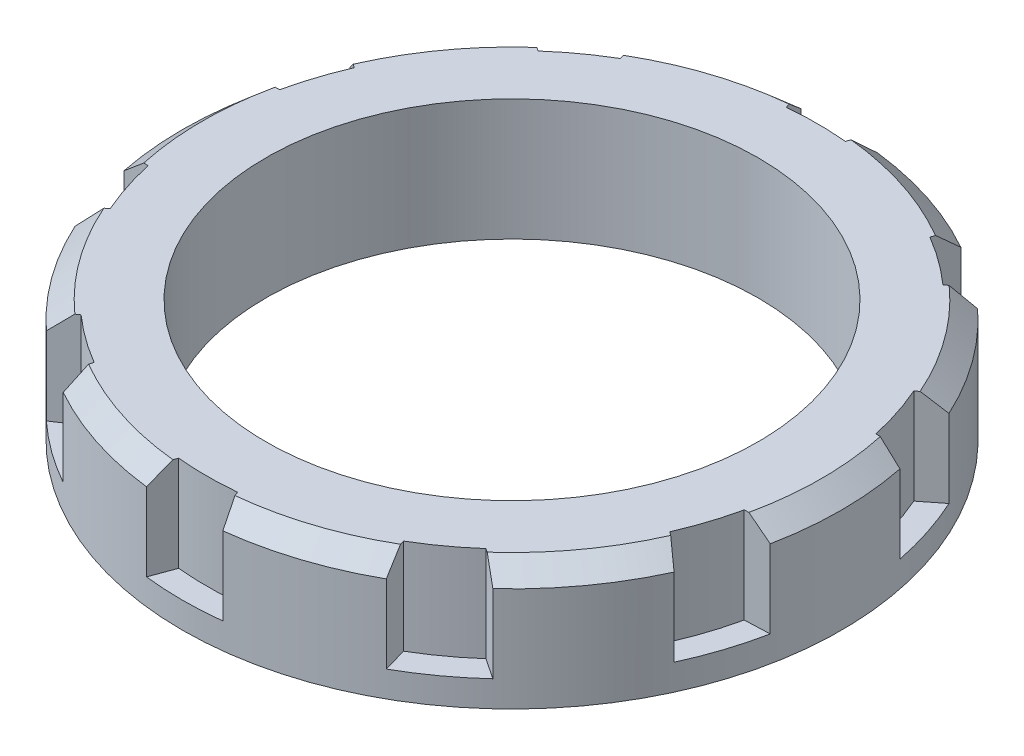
ISO-10303-21;
HEADER;
FILE_DESCRIPTION(('STEP AP214'),'2;1');
FILE_NAME('part.step','',(''),(''),'','','');
FILE_SCHEMA(('AUTOMOTIVE_DESIGN { 1 0 10303 214 1 1 1 1 }'));
ENDSEC;
DATA;
#1=APPLICATION_CONTEXT('core data for automotive mechanical design processes');
#2=APPLICATION_PROTOCOL_DEFINITION('international standard','automotive_design',2000,#1);
#3=PRODUCT_CONTEXT('',#1,'mechanical');
#4=PRODUCT('Part','Part','',(#3));
#5=PRODUCT_RELATED_PRODUCT_CATEGORY('part','',(#4));
#6=PRODUCT_DEFINITION_FORMATION('','',#4);
#7=PRODUCT_DEFINITION_CONTEXT('part definition',#1,'design');
#8=PRODUCT_DEFINITION('design','',#6,#7);
#9=PRODUCT_DEFINITION_SHAPE('','',#8);
#10=(LENGTH_UNIT() NAMED_UNIT(*) SI_UNIT(.MILLI.,.METRE.));
#11=(NAMED_UNIT(*) PLANE_ANGLE_UNIT() SI_UNIT($,.RADIAN.));
#12=(NAMED_UNIT(*) SI_UNIT($,.STERADIAN.) SOLID_ANGLE_UNIT());
#13=UNCERTAINTY_MEASURE_WITH_UNIT(LENGTH_MEASURE(1.E-05),#10,'distance_accuracy_value','');
#14=(GEOMETRIC_REPRESENTATION_CONTEXT(3) GLOBAL_UNCERTAINTY_ASSIGNED_CONTEXT((#13)) GLOBAL_UNIT_ASSIGNED_CONTEXT((#10,
#11,#12)) REPRESENTATION_CONTEXT('',''));
#15=CARTESIAN_POINT('',(0.,0.,0.));
#16=DIRECTION('',(0.,0.,1.));
#17=DIRECTION('',(1.,0.,0.));
#18=AXIS2_PLACEMENT_3D('',#15,#16,#17);
#19=CARTESIAN_POINT('',(0.,7.,0.));
#20=DIRECTION('',(0.,-1.,0.));
#21=DIRECTION('',(0.,0.,-1.));
#22=AXIS2_PLACEMENT_3D('',#19,#20,#21);
#23=CONICAL_SURFACE('',#22,17.85,0.855052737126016);
#24=CARTESIAN_POINT('',(-18.6285678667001,5.99983084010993,-3.73949883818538));
#25=CARTESIAN_POINT('',(-18.4312296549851,6.16674957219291,-3.74729079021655));
#26=CARTESIAN_POINT('',(-18.2338111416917,6.33357303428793,-3.75508591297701));
#27=CARTESIAN_POINT('',(-17.8388135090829,6.66702942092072,-3.77068250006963));
#28=CARTESIAN_POINT('',(-17.6412343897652,6.83366234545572,-3.77848396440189));
#29=CARTESIAN_POINT('',(-17.4435749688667,7.0002,-3.78628859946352));
#30=B_SPLINE_CURVE_WITH_KNOTS('',3,(#24,#25,#26,#27,#28,#29),.UNSPECIFIED.,.F.,.F.,(4,2,4),(0.,
0.775747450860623,1.55149491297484),.UNSPECIFIED.);
#31=CARTESIAN_POINT('',(-18.6283678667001,6.,-3.73950673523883));
#32=VERTEX_POINT('',#31);
#33=CARTESIAN_POINT('',(-17.4438123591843,7.,-3.78627922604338));
#34=VERTEX_POINT('',#33);
#35=EDGE_CURVE('E429',#32,#34,#30,.T.);
#36=ORIENTED_EDGE('',*,*,#35,.F.);
#37=CARTESIAN_POINT('',(0.,6.,0.));
#38=DIRECTION('',(0.,-1.,0.));
#39=DIRECTION('',(0.,0.,-1.));
#40=AXIS2_PLACEMENT_3D('',#37,#38,#39);
#41=CIRCLE('',#40,19.);
#42=CARTESIAN_POINT('',(-18.6283678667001,6.,3.73950673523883));
#43=VERTEX_POINT('',#42);
#44=EDGE_CURVE('E688',#43,#32,#41,.T.);
#45=ORIENTED_EDGE('',*,*,#44,.F.);
#46=CARTESIAN_POINT('',(-17.4435749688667,7.0002,3.78628859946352));
#47=CARTESIAN_POINT('',(-17.6412343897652,6.83366234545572,3.77848396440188));
#48=CARTESIAN_POINT('',(-17.8388135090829,6.66702942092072,3.77068250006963));
#49=CARTESIAN_POINT('',(-18.2338111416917,6.33357303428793,3.75508591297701));
#50=CARTESIAN_POINT('',(-18.4312296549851,6.16674957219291,3.74729079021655));
#51=CARTESIAN_POINT('',(-18.6285678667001,5.99983084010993,3.73949883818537));
#52=B_SPLINE_CURVE_WITH_KNOTS('',3,(#46,#47,#48,#49,#50,#51),.UNSPECIFIED.,.F.,.F.,(4,2,4),(0.,
0.775747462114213,1.55149491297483),.UNSPECIFIED.);
#53=CARTESIAN_POINT('',(-17.4438123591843,7.,3.78627922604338));
#54=VERTEX_POINT('',#53);
#55=EDGE_CURVE('E362',#54,#43,#52,.T.);
#56=ORIENTED_EDGE('',*,*,#55,.F.);
#57=CARTESIAN_POINT('',(0.,7.,0.));
#58=DIRECTION('',(0.,-1.,0.));
#59=DIRECTION('',(0.,0.,-1.));
#60=AXIS2_PLACEMENT_3D('',#57,#58,#59);
#61=CIRCLE('',#60,17.85);
#62=EDGE_CURVE('E690',#54,#34,#61,.T.);
#63=ORIENTED_EDGE('',*,*,#62,.T.);
#64=EDGE_LOOP('',(#36,#45,#56,#63));
#65=FACE_BOUND('',#64,.T.);
#66=ADVANCED_FACE('F39',(#65),#23,.T.);
#67=CARTESIAN_POINT('',(-16.3376731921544,7.0002,-7.18990429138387));
#68=CARTESIAN_POINT('',(-16.493000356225,6.83365721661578,-7.31240343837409));
#69=CARTESIAN_POINT('',(-16.6482644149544,6.66701915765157,-7.43485281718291));
#70=CARTESIAN_POINT('',(-16.958666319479,6.33355249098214,-7.67965203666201));
#71=CARTESIAN_POINT('',(-17.113804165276,6.16672388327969,-7.80200187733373));
#72=CARTESIAN_POINT('',(-17.2688789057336,5.9998,-7.9243019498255));
#73=B_SPLINE_CURVE_WITH_KNOTS('',3,(#67,#68,#69,#70,#71,#72),.UNSPECIFIED.,.F.,.F.,(4,2,4),(0.,
0.775771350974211,1.55154269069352),.UNSPECIFIED.);
#74=CARTESIAN_POINT('',(-16.3378597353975,7.,-7.19005140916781));
#75=VERTEX_POINT('',#74);
#76=CARTESIAN_POINT('',(-17.2686930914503,6.,-7.92415540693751));
#77=VERTEX_POINT('',#76);
#78=EDGE_CURVE('E435',#75,#77,#73,.T.);
#79=ORIENTED_EDGE('',*,*,#78,.F.);
#80=CARTESIAN_POINT('',(-11.8868215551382,7.,-13.3163798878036));
#81=VERTEX_POINT('',#80);
#82=EDGE_CURVE('E825',#75,#81,#61,.T.);
#83=ORIENTED_EDGE('',*,*,#82,.T.);
#84=CARTESIAN_POINT('',(-12.8728392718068,5.999796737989,-13.9749379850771));
#85=CARTESIAN_POINT('',(-12.7086037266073,6.16672116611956,-13.8652455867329));
#86=CARTESIAN_POINT('',(-12.5443013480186,6.3335503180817,-13.7555085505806));
#87=CARTESIAN_POINT('',(-12.2155629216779,6.66701807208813,-13.5359452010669));
#88=CARTESIAN_POINT('',(-12.051126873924,6.83365667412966,-13.4261188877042));
#89=CARTESIAN_POINT('',(-11.8866239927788,7.0002,-13.3162479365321));
#90=B_SPLINE_CURVE_WITH_KNOTS('',3,(#84,#85,#86,#87,#88,#89),.UNSPECIFIED.,.F.,.F.,(4,2,4),(0.,
0.775773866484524,1.55154774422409),.UNSPECIFIED.);
#91=CARTESIAN_POINT('',(-12.8726392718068,6.,-13.9748044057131));
#92=VERTEX_POINT('',#91);
#93=EDGE_CURVE('E461',#92,#81,#90,.T.);
#94=ORIENTED_EDGE('',*,*,#93,.F.);
#95=EDGE_CURVE('E695',#77,#92,#41,.T.);
#96=ORIENTED_EDGE('',*,*,#95,.F.);
#97=EDGE_LOOP('',(#79,#83,#94,#96));
#98=FACE_BOUND('',#97,.T.);
#99=ADVANCED_FACE('F679',(#98),#23,.T.);
#100=CARTESIAN_POINT('',(-8.99133555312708,7.0002,-15.4197981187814));
#101=CARTESIAN_POINT('',(-9.04499336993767,6.8336612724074,-15.6101963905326));
#102=CARTESIAN_POINT('',(-9.09862938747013,6.6670272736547,-15.8005173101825));
#103=CARTESIAN_POINT('',(-9.205857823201,6.33356873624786,-16.1810044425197));
#104=CARTESIAN_POINT('',(-9.25945024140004,6.16674419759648,-16.3711706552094));
#105=CARTESIAN_POINT('',(-9.31302086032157,5.99982438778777,-16.5612595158));
#106=B_SPLINE_CURVE_WITH_KNOTS('',3,(#100,#101,#102,#103,#104,#105),.UNSPECIFIED.,.F.,.F.,(4,2,
4),(0.,0.775752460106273,1.55150490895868),.UNSPECIFIED.);
#107=CARTESIAN_POINT('',(-8.99139999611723,7.,-15.420026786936));
#108=VERTEX_POINT('',#107);
#109=CARTESIAN_POINT('',(-9.31296449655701,6.,-16.5610595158));
#110=VERTEX_POINT('',#109);
#111=EDGE_CURVE('E466',#108,#110,#106,.T.);
#112=ORIENTED_EDGE('',*,*,#111,.F.);
#113=CARTESIAN_POINT('',(-1.78946893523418,7.,-17.7600760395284));
#114=VERTEX_POINT('',#113);
#115=EDGE_CURVE('E428',#108,#114,#61,.T.);
#116=ORIENTED_EDGE('',*,*,#115,.T.);
#117=CARTESIAN_POINT('',(-2.20007382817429,5.99981982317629,-18.8724017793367));
#118=CARTESIAN_POINT('',(-2.13168162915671,6.16674039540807,-18.6871277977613));
#119=CARTESIAN_POINT('',(-2.06326159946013,6.33356569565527,-18.5017784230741));
#120=CARTESIAN_POINT('',(-1.92636587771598,6.66702575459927,-18.1309288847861));
#121=CARTESIAN_POINT('',(-1.8578901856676,6.83366051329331,-17.9454287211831));
#122=CARTESIAN_POINT('',(-1.78938666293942,7.0002,-17.759853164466));
#123=B_SPLINE_CURVE_WITH_KNOTS('',3,(#117,#118,#119,#120,#121,#122),.UNSPECIFIED.,.F.,.F.,(4,2,
4),(0.,0.775755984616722,1.5515119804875),.UNSPECIFIED.);
#124=CARTESIAN_POINT('',(-2.2,6.,-18.8722017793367));
#125=VERTEX_POINT('',#124);
#126=EDGE_CURVE('E471',#125,#114,#123,.T.);
#127=ORIENTED_EDGE('',*,*,#126,.F.);
#128=EDGE_CURVE('E414',#110,#125,#41,.T.);
#129=ORIENTED_EDGE('',*,*,#128,.F.);
#130=EDGE_LOOP('',(#112,#116,#127,#129));
#131=FACE_BOUND('',#130,.T.);
#132=ADVANCED_FACE('F684',(#131),#23,.T.);
#133=CARTESIAN_POINT('',(1.78938666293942,7.0002,-17.759853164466));
#134=CARTESIAN_POINT('',(1.8578901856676,6.83366051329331,-17.9454287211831));
#135=CARTESIAN_POINT('',(1.92636587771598,6.66702575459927,-18.1309288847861));
#136=CARTESIAN_POINT('',(2.06326159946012,6.33356569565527,-18.5017784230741));
#137=CARTESIAN_POINT('',(2.13168162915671,6.16674039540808,-18.6871277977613));
#138=CARTESIAN_POINT('',(2.20007382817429,5.99981982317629,-18.8724017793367));
#139=B_SPLINE_CURVE_WITH_KNOTS('',3,(#133,#134,#135,#136,#137,#138),.UNSPECIFIED.,.F.,.F.,(4,2,
4),(0.,0.775755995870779,1.5515119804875),.UNSPECIFIED.);
#140=CARTESIAN_POINT('',(1.78946893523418,7.,-17.7600760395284));
#141=VERTEX_POINT('',#140);
#142=CARTESIAN_POINT('',(2.2,6.,-18.8722017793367));
#143=VERTEX_POINT('',#142);
#144=EDGE_CURVE('E500',#141,#143,#139,.T.);
#145=ORIENTED_EDGE('',*,*,#144,.F.);
#146=CARTESIAN_POINT('',(8.99139999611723,7.,-15.420026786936));
#147=VERTEX_POINT('',#146);
#148=EDGE_CURVE('E424',#141,#147,#61,.T.);
#149=ORIENTED_EDGE('',*,*,#148,.T.);
#150=CARTESIAN_POINT('',(9.31302086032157,5.99982438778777,-16.5612595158));
#151=CARTESIAN_POINT('',(9.25945024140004,6.16674419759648,-16.3711706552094));
#152=CARTESIAN_POINT('',(9.205857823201,6.33356873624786,-16.1810044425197));
#153=CARTESIAN_POINT('',(9.09862938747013,6.6670272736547,-15.8005173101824));
#154=CARTESIAN_POINT('',(9.04499336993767,6.8336612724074,-15.6101963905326));
#155=CARTESIAN_POINT('',(8.99133555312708,7.0002,-15.4197981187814));
#156=B_SPLINE_CURVE_WITH_KNOTS('',3,(#150,#151,#152,#153,#154,#155),.UNSPECIFIED.,.F.,.F.,(4,2,
4),(0.,0.775752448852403,1.55150490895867),.UNSPECIFIED.);
#157=CARTESIAN_POINT('',(9.31296449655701,6.,-16.5610595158));
#158=VERTEX_POINT('',#157);
#159=EDGE_CURVE('E505',#158,#147,#156,.T.);
#160=ORIENTED_EDGE('',*,*,#159,.F.);
#161=EDGE_CURVE('E410',#143,#158,#41,.T.);
#162=ORIENTED_EDGE('',*,*,#161,.F.);
#163=EDGE_LOOP('',(#145,#149,#160,#162));
#164=FACE_BOUND('',#163,.T.);
#165=ADVANCED_FACE('F927',(#164),#23,.T.);
#166=CARTESIAN_POINT('',(11.8866239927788,7.0002,-13.3162479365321));
#167=CARTESIAN_POINT('',(12.051126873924,6.83365667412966,-13.4261188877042));
#168=CARTESIAN_POINT('',(12.2155629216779,6.66701807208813,-13.5359452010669));
#169=CARTESIAN_POINT('',(12.5443013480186,6.33355031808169,-13.7555085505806));
#170=CARTESIAN_POINT('',(12.7086037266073,6.16672116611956,-13.8652455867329));
#171=CARTESIAN_POINT('',(12.8728392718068,5.999796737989,-13.9749379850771));
#172=B_SPLINE_CURVE_WITH_KNOTS('',3,(#166,#167,#168,#169,#170,#171),.UNSPECIFIED.,.F.,.F.,(4,2,
4),(0.,0.775773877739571,1.5515477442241),.UNSPECIFIED.);
#173=CARTESIAN_POINT('',(11.8868215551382,7.,-13.3163798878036));
#174=VERTEX_POINT('',#173);
#175=CARTESIAN_POINT('',(12.8726392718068,6.,-13.9748044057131));
#176=VERTEX_POINT('',#175);
#177=EDGE_CURVE('E510',#174,#176,#172,.T.);
#178=ORIENTED_EDGE('',*,*,#177,.F.);
#179=CARTESIAN_POINT('',(16.3378597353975,7.,-7.19005140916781));
#180=VERTEX_POINT('',#179);
#181=EDGE_CURVE('E427',#174,#180,#61,.T.);
#182=ORIENTED_EDGE('',*,*,#181,.T.);
#183=CARTESIAN_POINT('',(17.2688789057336,5.9998,-7.92430194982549));
#184=CARTESIAN_POINT('',(17.113804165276,6.16672388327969,-7.80200187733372));
#185=CARTESIAN_POINT('',(16.958666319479,6.33355249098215,-7.67965203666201));
#186=CARTESIAN_POINT('',(16.6482644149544,6.66701915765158,-7.43485281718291));
#187=CARTESIAN_POINT('',(16.493000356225,6.83365721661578,-7.31240343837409));
#188=CARTESIAN_POINT('',(16.3376731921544,7.0002,-7.18990429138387));
#189=B_SPLINE_CURVE_WITH_KNOTS('',3,(#183,#184,#185,#186,#187,#188),.UNSPECIFIED.,.F.,.F.,(4,2,
4),(0.,0.775771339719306,1.55154269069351),.UNSPECIFIED.);
#190=CARTESIAN_POINT('',(17.2686930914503,6.,-7.9241554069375));
#191=VERTEX_POINT('',#190);
#192=EDGE_CURVE('E516',#191,#180,#189,.T.);
#193=ORIENTED_EDGE('',*,*,#192,.F.);
#194=EDGE_CURVE('E413',#176,#191,#41,.T.);
#195=ORIENTED_EDGE('',*,*,#194,.F.);
#196=EDGE_LOOP('',(#178,#182,#193,#195));
#197=FACE_BOUND('',#196,.T.);
#198=ADVANCED_FACE('F1041',(#197),#23,.T.);
#199=CARTESIAN_POINT('',(17.4435749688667,7.0002,-3.78628859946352));
#200=CARTESIAN_POINT('',(17.6412343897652,6.83366234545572,-3.77848396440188));
#201=CARTESIAN_POINT('',(17.8388135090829,6.66702942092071,-3.77068250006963));
#202=CARTESIAN_POINT('',(18.2338111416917,6.33357303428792,-3.75508591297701));
#203=CARTESIAN_POINT('',(18.4312296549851,6.1667495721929,-3.74729079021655));
#204=CARTESIAN_POINT('',(18.6285678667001,5.99983084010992,-3.73949883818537));
#205=B_SPLINE_CURVE_WITH_KNOTS('',3,(#199,#200,#201,#202,#203,#204),.UNSPECIFIED.,.F.,.F.,(4,2,
4),(0.,0.775747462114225,1.55149491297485),.UNSPECIFIED.);
#206=CARTESIAN_POINT('',(17.4438123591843,7.,-3.78627922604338));
#207=VERTEX_POINT('',#206);
#208=CARTESIAN_POINT('',(18.6283678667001,6.,-3.73950673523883));
#209=VERTEX_POINT('',#208);
#210=EDGE_CURVE('E546',#207,#209,#205,.T.);
#211=ORIENTED_EDGE('',*,*,#210,.F.);
#212=CARTESIAN_POINT('',(17.4438123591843,7.,3.78627922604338));
#213=VERTEX_POINT('',#212);
#214=EDGE_CURVE('E1070',#207,#213,#61,.T.);
#215=ORIENTED_EDGE('',*,*,#214,.T.);
#216=CARTESIAN_POINT('',(18.6285678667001,5.99983084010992,3.73949883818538));
#217=CARTESIAN_POINT('',(18.4312296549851,6.16674957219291,3.74729079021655));
#218=CARTESIAN_POINT('',(18.2338111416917,6.33357303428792,3.75508591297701));
#219=CARTESIAN_POINT('',(17.8388135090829,6.66702942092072,3.77068250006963));
#220=CARTESIAN_POINT('',(17.6412343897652,6.83366234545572,3.77848396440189));
#221=CARTESIAN_POINT('',(17.4435749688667,7.0002,3.78628859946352));
#222=B_SPLINE_CURVE_WITH_KNOTS('',3,(#216,#217,#218,#219,#220,#221),.UNSPECIFIED.,.F.,.F.,(4,2,
4),(0.,0.775747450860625,1.55149491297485),.UNSPECIFIED.);
#223=CARTESIAN_POINT('',(18.6283678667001,6.,3.73950673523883));
#224=VERTEX_POINT('',#223);
#225=EDGE_CURVE('E551',#224,#213,#222,.T.);
#226=ORIENTED_EDGE('',*,*,#225,.F.);
#227=EDGE_CURVE('E870',#209,#224,#41,.T.);
#228=ORIENTED_EDGE('',*,*,#227,.F.);
#229=EDGE_LOOP('',(#211,#215,#226,#228));
#230=FACE_BOUND('',#229,.T.);
#231=ADVANCED_FACE('F1285',(#230),#23,.T.);
#232=CARTESIAN_POINT('',(16.3376731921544,7.0002,7.18990429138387));
#233=CARTESIAN_POINT('',(16.493000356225,6.83365721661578,7.31240343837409));
#234=CARTESIAN_POINT('',(16.6482644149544,6.66701915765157,7.43485281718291));
#235=CARTESIAN_POINT('',(16.958666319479,6.33355249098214,7.67965203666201));
#236=CARTESIAN_POINT('',(17.113804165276,6.16672388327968,7.80200187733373));
#237=CARTESIAN_POINT('',(17.2688789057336,5.9998,7.9243019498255));
#238=B_SPLINE_CURVE_WITH_KNOTS('',3,(#232,#233,#234,#235,#236,#237),.UNSPECIFIED.,.F.,.F.,(4,2,
4),(0.,0.775771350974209,1.55154269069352),.UNSPECIFIED.);
#239=CARTESIAN_POINT('',(16.3378597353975,7.,7.19005140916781));
#240=VERTEX_POINT('',#239);
#241=CARTESIAN_POINT('',(17.2686930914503,6.,7.92415540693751));
#242=VERTEX_POINT('',#241);
#243=EDGE_CURVE('E556',#240,#242,#238,.T.);
#244=ORIENTED_EDGE('',*,*,#243,.F.);
#245=CARTESIAN_POINT('',(11.8868215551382,7.,13.3163798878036));
#246=VERTEX_POINT('',#245);
#247=EDGE_CURVE('E1066',#240,#246,#61,.T.);
#248=ORIENTED_EDGE('',*,*,#247,.T.);
#249=CARTESIAN_POINT('',(12.8728392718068,5.999796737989,13.9749379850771));
#250=CARTESIAN_POINT('',(12.7086037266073,6.16672116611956,13.8652455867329));
#251=CARTESIAN_POINT('',(12.5443013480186,6.33355031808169,13.7555085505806));
#252=CARTESIAN_POINT('',(12.2155629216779,6.66701807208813,13.5359452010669));
#253=CARTESIAN_POINT('',(12.051126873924,6.83365667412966,13.4261188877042));
#254=CARTESIAN_POINT('',(11.8866239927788,7.0002,13.3162479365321));
#255=B_SPLINE_CURVE_WITH_KNOTS('',3,(#249,#250,#251,#252,#253,#254),.UNSPECIFIED.,.F.,.F.,(4,2,
4),(0.,0.775773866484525,1.5515477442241),.UNSPECIFIED.);
#256=CARTESIAN_POINT('',(12.8726392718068,6.,13.9748044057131));
#257=VERTEX_POINT('',#256);
#258=EDGE_CURVE('E562',#257,#246,#255,.T.);
#259=ORIENTED_EDGE('',*,*,#258,.F.);
#260=EDGE_CURVE('E868',#242,#257,#41,.T.);
#261=ORIENTED_EDGE('',*,*,#260,.F.);
#262=EDGE_LOOP('',(#244,#248,#259,#261));
#263=FACE_BOUND('',#262,.T.);
#264=ADVANCED_FACE('F1441',(#263),#23,.T.);
#265=CARTESIAN_POINT('',(8.99133555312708,7.0002,15.4197981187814));
#266=CARTESIAN_POINT('',(9.04499336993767,6.8336612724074,15.6101963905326));
#267=CARTESIAN_POINT('',(9.09862938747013,6.6670272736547,15.8005173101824));
#268=CARTESIAN_POINT('',(9.205857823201,6.33356873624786,16.1810044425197));
#269=CARTESIAN_POINT('',(9.25945024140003,6.16674419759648,16.3711706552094));
#270=CARTESIAN_POINT('',(9.31302086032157,5.99982438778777,16.5612595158));
#271=B_SPLINE_CURVE_WITH_KNOTS('',3,(#265,#266,#267,#268,#269,#270),.UNSPECIFIED.,.F.,.F.,(4,2,
4),(0.,0.775752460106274,1.55150490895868),.UNSPECIFIED.);
#272=CARTESIAN_POINT('',(8.99139999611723,7.,15.420026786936));
#273=VERTEX_POINT('',#272);
#274=CARTESIAN_POINT('',(9.31296449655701,6.,16.5610595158));
#275=VERTEX_POINT('',#274);
#276=EDGE_CURVE('E592',#273,#275,#271,.T.);
#277=ORIENTED_EDGE('',*,*,#276,.F.);
#278=CARTESIAN_POINT('',(1.78946893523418,7.,17.7600760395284));
#279=VERTEX_POINT('',#278);
#280=EDGE_CURVE('E1071',#273,#279,#61,.T.);
#281=ORIENTED_EDGE('',*,*,#280,.T.);
#282=CARTESIAN_POINT('',(2.20007382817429,5.99981982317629,18.8724017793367));
#283=CARTESIAN_POINT('',(2.13168162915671,6.16674039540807,18.6871277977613));
#284=CARTESIAN_POINT('',(2.06326159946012,6.33356569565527,18.5017784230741));
#285=CARTESIAN_POINT('',(1.92636587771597,6.66702575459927,18.1309288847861));
#286=CARTESIAN_POINT('',(1.8578901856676,6.83366051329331,17.9454287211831));
#287=CARTESIAN_POINT('',(1.78938666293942,7.0002,17.759853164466));
#288=B_SPLINE_CURVE_WITH_KNOTS('',3,(#282,#283,#284,#285,#286,#287),.UNSPECIFIED.,.F.,.F.,(4,2,
4),(0.,0.775755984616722,1.5515119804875),.UNSPECIFIED.);
#289=CARTESIAN_POINT('',(2.2,6.,18.8722017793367));
#290=VERTEX_POINT('',#289);
#291=EDGE_CURVE('E597',#290,#279,#288,.T.);
#292=ORIENTED_EDGE('',*,*,#291,.F.);
#293=EDGE_CURVE('E864',#275,#290,#41,.T.);
#294=ORIENTED_EDGE('',*,*,#293,.F.);
#295=EDGE_LOOP('',(#277,#281,#292,#294));
#296=FACE_BOUND('',#295,.T.);
#297=ADVANCED_FACE('F1075',(#296),#23,.T.);
#298=CARTESIAN_POINT('',(-1.78938666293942,7.0002,17.759853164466));
#299=CARTESIAN_POINT('',(-1.8578901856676,6.83366051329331,17.9454287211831));
#300=CARTESIAN_POINT('',(-1.92636587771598,6.66702575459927,18.1309288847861));
#301=CARTESIAN_POINT('',(-2.06326159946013,6.33356569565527,18.5017784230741));
#302=CARTESIAN_POINT('',(-2.13168162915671,6.16674039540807,18.6871277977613));
#303=CARTESIAN_POINT('',(-2.20007382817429,5.99981982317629,18.8724017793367));
#304=B_SPLINE_CURVE_WITH_KNOTS('',3,(#298,#299,#300,#301,#302,#303),.UNSPECIFIED.,.F.,.F.,(4,2,
4),(0.,0.775755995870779,1.5515119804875),.UNSPECIFIED.);
#305=CARTESIAN_POINT('',(-1.78946893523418,7.,17.7600760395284));
#306=VERTEX_POINT('',#305);
#307=CARTESIAN_POINT('',(-2.2,6.,18.8722017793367));
#308=VERTEX_POINT('',#307);
#309=EDGE_CURVE('E602',#306,#308,#304,.T.);
#310=ORIENTED_EDGE('',*,*,#309,.F.);
#311=CARTESIAN_POINT('',(-8.99139999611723,7.,15.420026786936));
#312=VERTEX_POINT('',#311);
#313=EDGE_CURVE('E827',#306,#312,#61,.T.);
#314=ORIENTED_EDGE('',*,*,#313,.T.);
#315=CARTESIAN_POINT('',(-9.31302086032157,5.99982438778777,16.5612595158));
#316=CARTESIAN_POINT('',(-9.25945024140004,6.16674419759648,16.3711706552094));
#317=CARTESIAN_POINT('',(-9.205857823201,6.33356873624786,16.1810044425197));
#318=CARTESIAN_POINT('',(-9.09862938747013,6.6670272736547,15.8005173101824));
#319=CARTESIAN_POINT('',(-9.04499336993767,6.8336612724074,15.6101963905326));
#320=CARTESIAN_POINT('',(-8.99133555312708,7.0002,15.4197981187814));
#321=B_SPLINE_CURVE_WITH_KNOTS('',3,(#315,#316,#317,#318,#319,#320),.UNSPECIFIED.,.F.,.F.,(4,2,
4),(0.,0.775752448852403,1.55150490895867),.UNSPECIFIED.);
#322=CARTESIAN_POINT('',(-9.31296449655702,6.,16.5610595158));
#323=VERTEX_POINT('',#322);
#324=EDGE_CURVE('E608',#323,#312,#321,.T.);
#325=ORIENTED_EDGE('',*,*,#324,.F.);
#326=EDGE_CURVE('E696',#308,#323,#41,.T.);
#327=ORIENTED_EDGE('',*,*,#326,.F.);
#328=EDGE_LOOP('',(#310,#314,#325,#327));
#329=FACE_BOUND('',#328,.T.);
#330=ADVANCED_FACE('F676',(#329),#23,.T.);
#331=CARTESIAN_POINT('',(-11.8866239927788,7.0002,13.3162479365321));
#332=CARTESIAN_POINT('',(-12.051126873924,6.83365667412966,13.4261188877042));
#333=CARTESIAN_POINT('',(-12.2155629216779,6.66701807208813,13.5359452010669));
#334=CARTESIAN_POINT('',(-12.5443013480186,6.33355031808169,13.7555085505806));
#335=CARTESIAN_POINT('',(-12.7086037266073,6.16672116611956,13.8652455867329));
#336=CARTESIAN_POINT('',(-12.8728392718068,5.999796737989,13.9749379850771));
#337=B_SPLINE_CURVE_WITH_KNOTS('',3,(#331,#332,#333,#334,#335,#336),.UNSPECIFIED.,.F.,.F.,(4,2,
4),(0.,0.77577387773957,1.5515477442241),.UNSPECIFIED.);
#338=CARTESIAN_POINT('',(-11.8868215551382,7.,13.3163798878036));
#339=VERTEX_POINT('',#338);
#340=CARTESIAN_POINT('',(-12.8726392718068,6.,13.9748044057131));
#341=VERTEX_POINT('',#340);
#342=EDGE_CURVE('E637',#339,#341,#337,.T.);
#343=ORIENTED_EDGE('',*,*,#342,.F.);
#344=CARTESIAN_POINT('',(-16.3378597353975,7.,7.19005140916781));
#345=VERTEX_POINT('',#344);
#346=EDGE_CURVE('E824',#339,#345,#61,.T.);
#347=ORIENTED_EDGE('',*,*,#346,.T.);
#348=CARTESIAN_POINT('',(-17.2688789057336,5.9998,7.92430194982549));
#349=CARTESIAN_POINT('',(-17.113804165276,6.16672388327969,7.80200187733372));
#350=CARTESIAN_POINT('',(-16.958666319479,6.33355249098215,7.67965203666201));
#351=CARTESIAN_POINT('',(-16.6482644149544,6.66701915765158,7.43485281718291));
#352=CARTESIAN_POINT('',(-16.493000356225,6.83365721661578,7.31240343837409));
#353=CARTESIAN_POINT('',(-16.3376731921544,7.0002,7.18990429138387));
#354=B_SPLINE_CURVE_WITH_KNOTS('',3,(#348,#349,#350,#351,#352,#353),.UNSPECIFIED.,.F.,.F.,(4,2,
4),(0.,0.775771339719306,1.55154269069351),.UNSPECIFIED.);
#355=CARTESIAN_POINT('',(-17.2686930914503,6.,7.9241554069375));
#356=VERTEX_POINT('',#355);
#357=EDGE_CURVE('E642',#356,#345,#354,.T.);
#358=ORIENTED_EDGE('',*,*,#357,.F.);
#359=EDGE_CURVE('E694',#341,#356,#41,.T.);
#360=ORIENTED_EDGE('',*,*,#359,.F.);
#361=EDGE_LOOP('',(#343,#347,#358,#360));
#362=FACE_BOUND('',#361,.T.);
#363=ADVANCED_FACE('F672',(#362),#23,.T.);
#364=CARTESIAN_POINT('',(0.,7.,0.));
#365=DIRECTION('',(0.,-1.,0.));
#366=DIRECTION('',(0.,0.,-1.));
#367=AXIS2_PLACEMENT_3D('',#364,#365,#366);
#368=CYLINDRICAL_SURFACE('',#367,19.);
#369=DIRECTION('',(0.,1.,0.));
#370=VECTOR('',#369,1.);
#371=CARTESIAN_POINT('',(-18.6283678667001,1.5,-3.73950673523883));
#372=LINE('',#371,#370);
#373=CARTESIAN_POINT('',(-18.6283678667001,1.5,-3.73950673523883));
#374=VERTEX_POINT('',#373);
#375=EDGE_CURVE('E651',#374,#32,#372,.T.);
#376=ORIENTED_EDGE('',*,*,#375,.F.);
#377=CARTESIAN_POINT('',(0.,1.5,0.));
#378=DIRECTION('',(0.,1.,0.));
#379=DIRECTION('',(0.,0.,1.));
#380=AXIS2_PLACEMENT_3D('',#377,#378,#379);
#381=CIRCLE('',#380,19.);
#382=CARTESIAN_POINT('',(-17.2686930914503,1.5,-7.92415540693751));
#383=VERTEX_POINT('',#382);
#384=EDGE_CURVE('E839',#383,#374,#381,.T.);
#385=ORIENTED_EDGE('',*,*,#384,.F.);
#386=DIRECTION('',(0.,1.,0.));
#387=VECTOR('',#386,1.);
#388=CARTESIAN_POINT('',(-17.2686930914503,1.5,-7.92415540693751));
#389=LINE('',#388,#387);
#390=EDGE_CURVE('E739',#383,#77,#389,.T.);
#391=ORIENTED_EDGE('',*,*,#390,.T.);
#392=ORIENTED_EDGE('',*,*,#95,.T.);
#393=DIRECTION('',(0.,1.,0.));
#394=VECTOR('',#393,1.);
#395=CARTESIAN_POINT('',(-12.8726392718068,1.5,-13.9748044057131));
#396=LINE('',#395,#394);
#397=CARTESIAN_POINT('',(-12.8726392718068,1.5,-13.9748044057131));
#398=VERTEX_POINT('',#397);
#399=EDGE_CURVE('E741',#398,#92,#396,.T.);
#400=ORIENTED_EDGE('',*,*,#399,.F.);
#401=CARTESIAN_POINT('',(-9.31296449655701,1.5,-16.5610595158));
#402=VERTEX_POINT('',#401);
#403=EDGE_CURVE('E835',#402,#398,#381,.T.);
#404=ORIENTED_EDGE('',*,*,#403,.F.);
#405=DIRECTION('',(0.,1.,0.));
#406=VECTOR('',#405,1.);
#407=CARTESIAN_POINT('',(-9.31296449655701,1.5,-16.5610595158));
#408=LINE('',#407,#406);
#409=EDGE_CURVE('E708',#402,#110,#408,.T.);
#410=ORIENTED_EDGE('',*,*,#409,.T.);
#411=ORIENTED_EDGE('',*,*,#128,.T.);
#412=DIRECTION('',(0.,1.,0.));
#413=VECTOR('',#412,1.);
#414=CARTESIAN_POINT('',(-2.2,1.5,-18.8722017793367));
#415=LINE('',#414,#413);
#416=CARTESIAN_POINT('',(-2.2,1.5,-18.8722017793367));
#417=VERTEX_POINT('',#416);
#418=EDGE_CURVE('E706',#417,#125,#415,.T.);
#419=ORIENTED_EDGE('',*,*,#418,.F.);
#420=CARTESIAN_POINT('',(2.2,1.5,-18.8722017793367));
#421=VERTEX_POINT('',#420);
#422=EDGE_CURVE('E838',#421,#417,#381,.T.);
#423=ORIENTED_EDGE('',*,*,#422,.F.);
#424=DIRECTION('',(0.,1.,0.));
#425=VECTOR('',#424,1.);
#426=CARTESIAN_POINT('',(2.2,1.5,-18.8722017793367));
#427=LINE('',#426,#425);
#428=EDGE_CURVE('E754',#421,#143,#427,.T.);
#429=ORIENTED_EDGE('',*,*,#428,.T.);
#430=ORIENTED_EDGE('',*,*,#161,.T.);
#431=DIRECTION('',(0.,1.,0.));
#432=VECTOR('',#431,1.);
#433=CARTESIAN_POINT('',(9.31296449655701,1.5,-16.5610595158));
#434=LINE('',#433,#432);
#435=CARTESIAN_POINT('',(9.31296449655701,1.5,-16.5610595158));
#436=VERTEX_POINT('',#435);
#437=EDGE_CURVE('E757',#436,#158,#434,.T.);
#438=ORIENTED_EDGE('',*,*,#437,.F.);
#439=CARTESIAN_POINT('',(12.8726392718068,1.5,-13.9748044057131));
#440=VERTEX_POINT('',#439);
#441=EDGE_CURVE('E840',#440,#436,#381,.T.);
#442=ORIENTED_EDGE('',*,*,#441,.F.);
#443=DIRECTION('',(0.,1.,0.));
#444=VECTOR('',#443,1.);
#445=CARTESIAN_POINT('',(12.8726392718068,1.5,-13.9748044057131));
#446=LINE('',#445,#444);
#447=EDGE_CURVE('E764',#440,#176,#446,.T.);
#448=ORIENTED_EDGE('',*,*,#447,.T.);
#449=ORIENTED_EDGE('',*,*,#194,.T.);
#450=DIRECTION('',(0.,1.,0.));
#451=VECTOR('',#450,1.);
#452=CARTESIAN_POINT('',(17.2686930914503,1.5,-7.9241554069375));
#453=LINE('',#452,#451);
#454=CARTESIAN_POINT('',(17.2686930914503,1.5,-7.9241554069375));
#455=VERTEX_POINT('',#454);
#456=EDGE_CURVE('E767',#455,#191,#453,.T.);
#457=ORIENTED_EDGE('',*,*,#456,.F.);
#458=CARTESIAN_POINT('',(18.6283678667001,1.5,-3.73950673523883));
#459=VERTEX_POINT('',#458);
#460=EDGE_CURVE('E1019',#459,#455,#381,.T.);
#461=ORIENTED_EDGE('',*,*,#460,.F.);
#462=DIRECTION('',(0.,1.,0.));
#463=VECTOR('',#462,1.);
#464=CARTESIAN_POINT('',(18.6283678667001,1.5,-3.73950673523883));
#465=LINE('',#464,#463);
#466=EDGE_CURVE('E774',#459,#209,#465,.T.);
#467=ORIENTED_EDGE('',*,*,#466,.T.);
#468=ORIENTED_EDGE('',*,*,#227,.T.);
#469=DIRECTION('',(0.,1.,0.));
#470=VECTOR('',#469,1.);
#471=CARTESIAN_POINT('',(18.6283678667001,1.5,3.73950673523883));
#472=LINE('',#471,#470);
#473=CARTESIAN_POINT('',(18.6283678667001,1.5,3.73950673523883));
#474=VERTEX_POINT('',#473);
#475=EDGE_CURVE('E777',#474,#224,#472,.T.);
#476=ORIENTED_EDGE('',*,*,#475,.F.);
#477=CARTESIAN_POINT('',(17.2686930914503,1.5,7.92415540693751));
#478=VERTEX_POINT('',#477);
#479=EDGE_CURVE('E48',#478,#474,#381,.T.);
#480=ORIENTED_EDGE('',*,*,#479,.F.);
#481=DIRECTION('',(0.,1.,0.));
#482=VECTOR('',#481,1.);
#483=CARTESIAN_POINT('',(17.2686930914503,1.5,7.92415540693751));
#484=LINE('',#483,#482);
#485=EDGE_CURVE('E784',#478,#242,#484,.T.);
#486=ORIENTED_EDGE('',*,*,#485,.T.);
#487=ORIENTED_EDGE('',*,*,#260,.T.);
#488=DIRECTION('',(0.,1.,0.));
#489=VECTOR('',#488,1.);
#490=CARTESIAN_POINT('',(12.8726392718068,1.5,13.9748044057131));
#491=LINE('',#490,#489);
#492=CARTESIAN_POINT('',(12.8726392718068,1.5,13.9748044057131));
#493=VERTEX_POINT('',#492);
#494=EDGE_CURVE('E787',#493,#257,#491,.T.);
#495=ORIENTED_EDGE('',*,*,#494,.F.);
#496=CARTESIAN_POINT('',(9.31296449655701,1.5,16.5610595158));
#497=VERTEX_POINT('',#496);
#498=EDGE_CURVE('E11',#497,#493,#381,.T.);
#499=ORIENTED_EDGE('',*,*,#498,.F.);
#500=DIRECTION('',(0.,1.,0.));
#501=VECTOR('',#500,1.);
#502=CARTESIAN_POINT('',(9.31296449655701,1.5,16.5610595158));
#503=LINE('',#502,#501);
#504=EDGE_CURVE('E794',#497,#275,#503,.T.);
#505=ORIENTED_EDGE('',*,*,#504,.T.);
#506=ORIENTED_EDGE('',*,*,#293,.T.);
#507=DIRECTION('',(0.,1.,0.));
#508=VECTOR('',#507,1.);
#509=CARTESIAN_POINT('',(2.2,1.5,18.8722017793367));
#510=LINE('',#509,#508);
#511=CARTESIAN_POINT('',(2.2,1.5,18.8722017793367));
#512=VERTEX_POINT('',#511);
#513=EDGE_CURVE('E797',#512,#290,#510,.T.);
#514=ORIENTED_EDGE('',*,*,#513,.F.);
#515=CARTESIAN_POINT('',(-2.2,1.5,18.8722017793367));
#516=VERTEX_POINT('',#515);
#517=EDGE_CURVE('E387',#516,#512,#381,.T.);
#518=ORIENTED_EDGE('',*,*,#517,.F.);
#519=DIRECTION('',(0.,1.,0.));
#520=VECTOR('',#519,1.);
#521=CARTESIAN_POINT('',(-2.2,1.5,18.8722017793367));
#522=LINE('',#521,#520);
#523=EDGE_CURVE('E804',#516,#308,#522,.T.);
#524=ORIENTED_EDGE('',*,*,#523,.T.);
#525=ORIENTED_EDGE('',*,*,#326,.T.);
#526=DIRECTION('',(0.,1.,0.));
#527=VECTOR('',#526,1.);
#528=CARTESIAN_POINT('',(-9.31296449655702,1.5,16.5610595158));
#529=LINE('',#528,#527);
#530=CARTESIAN_POINT('',(-9.31296449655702,1.5,16.5610595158));
#531=VERTEX_POINT('',#530);
#532=EDGE_CURVE('E807',#531,#323,#529,.T.);
#533=ORIENTED_EDGE('',*,*,#532,.F.);
#534=CARTESIAN_POINT('',(-12.8726392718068,1.5,13.9748044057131));
#535=VERTEX_POINT('',#534);
#536=EDGE_CURVE('E385',#535,#531,#381,.T.);
#537=ORIENTED_EDGE('',*,*,#536,.F.);
#538=DIRECTION('',(0.,1.,0.));
#539=VECTOR('',#538,1.);
#540=CARTESIAN_POINT('',(-12.8726392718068,1.5,13.9748044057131));
#541=LINE('',#540,#539);
#542=EDGE_CURVE('E814',#535,#341,#541,.T.);
#543=ORIENTED_EDGE('',*,*,#542,.T.);
#544=ORIENTED_EDGE('',*,*,#359,.T.);
#545=DIRECTION('',(0.,1.,0.));
#546=VECTOR('',#545,1.);
#547=CARTESIAN_POINT('',(-17.2686930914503,1.5,7.9241554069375));
#548=LINE('',#547,#546);
#549=CARTESIAN_POINT('',(-17.2686930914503,1.5,7.9241554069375));
#550=VERTEX_POINT('',#549);
#551=EDGE_CURVE('E384',#550,#356,#548,.T.);
#552=ORIENTED_EDGE('',*,*,#551,.F.);
#553=CARTESIAN_POINT('',(-18.6283678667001,1.5,3.73950673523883));
#554=VERTEX_POINT('',#553);
#555=EDGE_CURVE('E43',#554,#550,#381,.T.);
#556=ORIENTED_EDGE('',*,*,#555,.F.);
#557=DIRECTION('',(0.,1.,0.));
#558=VECTOR('',#557,1.);
#559=CARTESIAN_POINT('',(-18.6283678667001,1.5,3.73950673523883));
#560=LINE('',#559,#558);
#561=EDGE_CURVE('E356',#554,#43,#560,.T.);
#562=ORIENTED_EDGE('',*,*,#561,.T.);
#563=ORIENTED_EDGE('',*,*,#44,.T.);
#564=EDGE_LOOP('',(#376,#385,#391,#392,#400,#404,#410,#411,#419,#423,#429,#430,#438,#442,#448,
#449,#457,#461,#467,#468,#476,#480,#486,#487,#495,#499,#505,#506,#514,#518,#524,#525,#533,#537,
#543,#544,#552,#556,#562,#563));
#565=FACE_BOUND('',#564,.T.);
#566=CARTESIAN_POINT('',(0.,0.,0.));
#567=DIRECTION('',(0.,-1.,0.));
#568=DIRECTION('',(0.,0.,-1.));
#569=AXIS2_PLACEMENT_3D('',#566,#567,#568);
#570=CIRCLE('',#569,19.);
#571=CARTESIAN_POINT('',(0.,0.,-19.));
#572=VERTEX_POINT('',#571);
#573=EDGE_CURVE('E415',#572,#572,#570,.T.);
#574=ORIENTED_EDGE('',*,*,#573,.F.);
#575=EDGE_LOOP('',(#574));
#576=FACE_BOUND('',#575,.T.);
#577=ADVANCED_FACE('F381',(#565,#576),#368,.T.);
#578=CARTESIAN_POINT('',(-14.188,7.,0.));
#579=DIRECTION('',(0.,-1.,0.));
#580=DIRECTION('',(0.,0.,-1.));
#581=AXIS2_PLACEMENT_3D('',#578,#579,#580);
#582=PLANE('',#581);
#583=CARTESIAN_POINT('',(0.,7.,0.));
#584=DIRECTION('',(0.,-1.,0.));
#585=DIRECTION('',(0.,0.,-1.));
#586=AXIS2_PLACEMENT_3D('',#583,#584,#585);
#587=CIRCLE('',#586,14.188);
#588=CARTESIAN_POINT('',(0.,7.,-14.188));
#589=VERTEX_POINT('',#588);
#590=EDGE_CURVE('E421',#589,#589,#587,.T.);
#591=ORIENTED_EDGE('',*,*,#590,.T.);
#592=EDGE_LOOP('',(#591));
#593=FACE_BOUND('',#592,.T.);
#594=DIRECTION('',(-0.999221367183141,0.,0.0394545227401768));
#595=VECTOR('',#594,1.);
#596=CARTESIAN_POINT('',(-17.1856566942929,7.,-3.79647257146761));
#597=LINE('',#596,#595);
#598=CARTESIAN_POINT('',(-17.1856566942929,7.,-3.79647257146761));
#599=VERTEX_POINT('',#598);
#600=EDGE_CURVE('E377',#599,#34,#597,.T.);
#601=ORIENTED_EDGE('',*,*,#600,.T.);
#602=ORIENTED_EDGE('',*,*,#62,.F.);
#603=DIRECTION('',(-0.99922136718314,0.,-0.0394545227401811));
#604=VECTOR('',#603,1.);
#605=CARTESIAN_POINT('',(-14.3423377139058,7.,3.908741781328));
#606=LINE('',#605,#604);
#607=CARTESIAN_POINT('',(-17.1856566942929,7.,3.79647257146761));
#608=VERTEX_POINT('',#607);
#609=EDGE_CURVE('E408',#608,#54,#606,.T.);
#610=ORIENTED_EDGE('',*,*,#609,.F.);
#611=CARTESIAN_POINT('',(0.,7.,0.));
#612=DIRECTION('',(0.,1.,0.));
#613=DIRECTION('',(0.,0.,1.));
#614=AXIS2_PLACEMENT_3D('',#611,#612,#613);
#615=CIRCLE('',#614,17.6);
#616=CARTESIAN_POINT('',(-16.1349989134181,7.,7.03006472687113));
#617=VERTEX_POINT('',#616);
#618=EDGE_CURVE('E823',#608,#617,#615,.T.);
#619=ORIENTED_EDGE('',*,*,#618,.T.);
#620=DIRECTION('',(-0.785196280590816,0.,0.619246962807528));
#621=VECTOR('',#620,1.);
#622=CARTESIAN_POINT('',(-16.1349989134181,7.,7.03006472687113));
#623=LINE('',#622,#621);
#624=EDGE_CURVE('E893',#617,#345,#623,.T.);
#625=ORIENTED_EDGE('',*,*,#624,.T.);
#626=ORIENTED_EDGE('',*,*,#346,.F.);
#627=DIRECTION('',(-0.831577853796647,0.,0.555408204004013));
#628=VECTOR('',#627,1.);
#629=CARTESIAN_POINT('',(-7.32776448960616,7.,10.2714001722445));
#630=LINE('',#629,#628);
#631=CARTESIAN_POINT('',(-11.671977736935,7.,13.1728863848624));
#632=VERTEX_POINT('',#631);
#633=EDGE_CURVE('E406',#632,#339,#630,.T.);
#634=ORIENTED_EDGE('',*,*,#633,.F.);
#635=CARTESIAN_POINT('',(0.,7.,0.));
#636=DIRECTION('',(0.,1.,0.));
#637=DIRECTION('',(0.,0.,1.));
#638=AXIS2_PLACEMENT_3D('',#635,#636,#637);
#639=CIRCLE('',#638,17.6);
#640=CARTESIAN_POINT('',(-8.92131995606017,7.,15.1713562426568));
#641=VERTEX_POINT('',#640);
#642=EDGE_CURVE('E887',#632,#641,#639,.T.);
#643=ORIENTED_EDGE('',*,*,#642,.T.);
#644=DIRECTION('',(-0.271252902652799,0.,0.962508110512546));
#645=VECTOR('',#644,1.);
#646=CARTESIAN_POINT('',(-8.92131995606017,7.,15.1713562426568));
#647=LINE('',#646,#645);
#648=EDGE_CURVE('E882',#641,#312,#647,.T.);
#649=ORIENTED_EDGE('',*,*,#648,.T.);
#650=ORIENTED_EDGE('',*,*,#313,.F.);
#651=DIRECTION('',(-0.346299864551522,0.,0.93812387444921));
#652=VECTOR('',#651,1.);
#653=CARTESIAN_POINT('',(2.49340908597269,7.,6.15778988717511));
#654=LINE('',#653,#652);
#655=CARTESIAN_POINT('',(-1.7,7.,17.5177053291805));
#656=VERTEX_POINT('',#655);
#657=EDGE_CURVE('E404',#656,#306,#654,.T.);
#658=ORIENTED_EDGE('',*,*,#657,.F.);
#659=CARTESIAN_POINT('',(0.,7.,0.));
#660=DIRECTION('',(0.,1.,0.));
#661=DIRECTION('',(0.,0.,1.));
#662=AXIS2_PLACEMENT_3D('',#659,#660,#661);
#663=CIRCLE('',#662,17.6);
#664=CARTESIAN_POINT('',(1.7,7.,17.5177053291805));
#665=VERTEX_POINT('',#664);
#666=EDGE_CURVE('E888',#656,#665,#663,.T.);
#667=ORIENTED_EDGE('',*,*,#666,.T.);
#668=DIRECTION('',(0.346299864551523,0.,0.93812387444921));
#669=VECTOR('',#668,1.);
#670=CARTESIAN_POINT('',(1.7,7.,17.5177053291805));
#671=LINE('',#670,#669);
#672=EDGE_CURVE('E891',#665,#279,#671,.T.);
#673=ORIENTED_EDGE('',*,*,#672,.T.);
#674=ORIENTED_EDGE('',*,*,#280,.F.);
#675=DIRECTION('',(0.271252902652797,0.,0.962508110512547));
#676=VECTOR('',#675,1.);
#677=CARTESIAN_POINT('',(3.25999423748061,7.,-4.91717319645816));
#678=LINE('',#677,#676);
#679=CARTESIAN_POINT('',(8.92131995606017,7.,15.1713562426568));
#680=VERTEX_POINT('',#679);
#681=EDGE_CURVE('E402',#680,#273,#678,.T.);
#682=ORIENTED_EDGE('',*,*,#681,.F.);
#683=CARTESIAN_POINT('',(0.,7.,0.));
#684=DIRECTION('',(0.,1.,0.));
#685=DIRECTION('',(0.,0.,1.));
#686=AXIS2_PLACEMENT_3D('',#683,#684,#685);
#687=CIRCLE('',#686,17.6);
#688=CARTESIAN_POINT('',(11.671977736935,7.,13.1728863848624));
#689=VERTEX_POINT('',#688);
#690=EDGE_CURVE('E899',#680,#689,#687,.T.);
#691=ORIENTED_EDGE('',*,*,#690,.T.);
#692=DIRECTION('',(0.831577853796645,0.,0.555408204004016));
#693=VECTOR('',#692,1.);
#694=CARTESIAN_POINT('',(11.671977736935,7.,13.1728863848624));
#695=LINE('',#694,#693);
#696=EDGE_CURVE('E902',#689,#246,#695,.T.);
#697=ORIENTED_EDGE('',*,*,#696,.T.);
#698=ORIENTED_EDGE('',*,*,#247,.F.);
#699=DIRECTION('',(0.785196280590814,0.,0.619246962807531));
#700=VECTOR('',#699,1.);
#701=CARTESIAN_POINT('',(-5.9783678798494,7.,-10.409695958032));
#702=LINE('',#701,#700);
#703=CARTESIAN_POINT('',(16.1349989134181,7.,7.03006472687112));
#704=VERTEX_POINT('',#703);
#705=EDGE_CURVE('E400',#704,#240,#702,.T.);
#706=ORIENTED_EDGE('',*,*,#705,.F.);
#707=CARTESIAN_POINT('',(0.,7.,0.));
#708=DIRECTION('',(0.,1.,0.));
#709=DIRECTION('',(0.,0.,1.));
#710=AXIS2_PLACEMENT_3D('',#707,#708,#709);
#711=CIRCLE('',#710,17.6);
#712=CARTESIAN_POINT('',(17.1856566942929,7.,3.79647257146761));
#713=VERTEX_POINT('',#712);
#714=EDGE_CURVE('E905',#704,#713,#711,.T.);
#715=ORIENTED_EDGE('',*,*,#714,.T.);
#716=DIRECTION('',(0.999221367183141,0.,-0.0394545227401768));
#717=VECTOR('',#716,1.);
#718=CARTESIAN_POINT('',(17.1856566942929,7.,3.79647257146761));
#719=LINE('',#718,#717);
#720=EDGE_CURVE('E908',#713,#213,#719,.T.);
#721=ORIENTED_EDGE('',*,*,#720,.T.);
#722=ORIENTED_EDGE('',*,*,#214,.F.);
#723=DIRECTION('',(0.99922136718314,0.,0.0394545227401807));
#724=VECTOR('',#723,1.);
#725=CARTESIAN_POINT('',(-13.9894905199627,7.,-5.02743159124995));
#726=LINE('',#725,#724);
#727=CARTESIAN_POINT('',(17.1856566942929,7.,-3.79647257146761));
#728=VERTEX_POINT('',#727);
#729=EDGE_CURVE('E398',#728,#207,#726,.T.);
#730=ORIENTED_EDGE('',*,*,#729,.F.);
#731=CARTESIAN_POINT('',(0.,7.,0.));
#732=DIRECTION('',(0.,1.,0.));
#733=DIRECTION('',(0.,0.,1.));
#734=AXIS2_PLACEMENT_3D('',#731,#732,#733);
#735=CIRCLE('',#734,17.6);
#736=CARTESIAN_POINT('',(16.1349989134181,7.,-7.03006472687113));
#737=VERTEX_POINT('',#736);
#738=EDGE_CURVE('E911',#728,#737,#735,.T.);
#739=ORIENTED_EDGE('',*,*,#738,.T.);
#740=DIRECTION('',(0.785196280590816,0.,-0.619246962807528));
#741=VECTOR('',#740,1.);
#742=CARTESIAN_POINT('',(16.1349989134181,7.,-7.03006472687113));
#743=LINE('',#742,#741);
#744=EDGE_CURVE('E914',#737,#180,#743,.T.);
#745=ORIENTED_EDGE('',*,*,#744,.T.);
#746=ORIENTED_EDGE('',*,*,#181,.F.);
#747=DIRECTION('',(0.831577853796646,0.,-0.555408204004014));
#748=VECTOR('',#747,1.);
#749=CARTESIAN_POINT('',(-12.2948560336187,7.,2.83448567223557));
#750=LINE('',#749,#748);
#751=CARTESIAN_POINT('',(11.671977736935,7.,-13.1728863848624));
#752=VERTEX_POINT('',#751);
#753=EDGE_CURVE('E396',#752,#174,#750,.T.);
#754=ORIENTED_EDGE('',*,*,#753,.F.);
#755=CARTESIAN_POINT('',(0.,7.,0.));
#756=DIRECTION('',(0.,1.,0.));
#757=DIRECTION('',(0.,0.,1.));
#758=AXIS2_PLACEMENT_3D('',#755,#756,#757);
#759=CIRCLE('',#758,17.6);
#760=CARTESIAN_POINT('',(8.92131995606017,7.,-15.1713562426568));
#761=VERTEX_POINT('',#760);
#762=EDGE_CURVE('E917',#752,#761,#759,.T.);
#763=ORIENTED_EDGE('',*,*,#762,.T.);
#764=DIRECTION('',(0.271252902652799,0.,-0.962508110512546));
#765=VECTOR('',#764,1.);
#766=CARTESIAN_POINT('',(8.92131995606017,7.,-15.1713562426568));
#767=LINE('',#766,#765);
#768=EDGE_CURVE('E726',#761,#147,#767,.T.);
#769=ORIENTED_EDGE('',*,*,#768,.T.);
#770=ORIENTED_EDGE('',*,*,#148,.F.);
#771=DIRECTION('',(0.346299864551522,0.,-0.93812387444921));
#772=VECTOR('',#771,1.);
#773=CARTESIAN_POINT('',(-5.8963610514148,7.,3.06078282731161));
#774=LINE('',#773,#772);
#775=CARTESIAN_POINT('',(1.7,7.,-17.5177053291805));
#776=VERTEX_POINT('',#775);
#777=EDGE_CURVE('E392',#776,#141,#774,.T.);
#778=ORIENTED_EDGE('',*,*,#777,.F.);
#779=CARTESIAN_POINT('',(0.,7.,0.));
#780=DIRECTION('',(0.,1.,0.));
#781=DIRECTION('',(0.,0.,1.));
#782=AXIS2_PLACEMENT_3D('',#779,#780,#781);
#783=CIRCLE('',#782,17.6);
#784=CARTESIAN_POINT('',(-1.7,7.,-17.5177053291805));
#785=VERTEX_POINT('',#784);
#786=EDGE_CURVE('E722',#776,#785,#783,.T.);
#787=ORIENTED_EDGE('',*,*,#786,.T.);
#788=DIRECTION('',(-0.346299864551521,0.,-0.938123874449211));
#789=VECTOR('',#788,1.);
#790=CARTESIAN_POINT('',(-1.7,7.,-17.5177053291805));
#791=LINE('',#790,#789);
#792=EDGE_CURVE('E716',#785,#114,#791,.T.);
#793=ORIENTED_EDGE('',*,*,#792,.T.);
#794=ORIENTED_EDGE('',*,*,#115,.F.);
#795=DIRECTION('',(-0.271252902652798,0.,-0.962508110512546));
#796=VECTOR('',#795,1.);
#797=CARTESIAN_POINT('',(-5.34784745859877,7.,-2.49132138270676));
#798=LINE('',#797,#796);
#799=CARTESIAN_POINT('',(-8.92131995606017,7.,-15.1713562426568));
#800=VERTEX_POINT('',#799);
#801=EDGE_CURVE('E388',#800,#108,#798,.T.);
#802=ORIENTED_EDGE('',*,*,#801,.F.);
#803=CARTESIAN_POINT('',(0.,7.,0.));
#804=DIRECTION('',(0.,1.,0.));
#805=DIRECTION('',(0.,0.,1.));
#806=AXIS2_PLACEMENT_3D('',#803,#804,#805);
#807=CIRCLE('',#806,17.6);
#808=CARTESIAN_POINT('',(-11.671977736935,7.,-13.1728863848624));
#809=VERTEX_POINT('',#808);
#810=EDGE_CURVE('E63',#800,#809,#807,.T.);
#811=ORIENTED_EDGE('',*,*,#810,.T.);
#812=DIRECTION('',(-0.831577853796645,0.,-0.555408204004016));
#813=VECTOR('',#812,1.);
#814=CARTESIAN_POINT('',(-11.671977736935,7.,-13.1728863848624));
#815=LINE('',#814,#813);
#816=EDGE_CURVE('E724',#809,#81,#815,.T.);
#817=ORIENTED_EDGE('',*,*,#816,.T.);
#818=ORIENTED_EDGE('',*,*,#82,.F.);
#819=DIRECTION('',(-0.785196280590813,0.,-0.619246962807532));
#820=VECTOR('',#819,1.);
#821=CARTESIAN_POINT('',(-11.5163781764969,7.,-3.38757821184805));
#822=LINE('',#821,#820);
#823=CARTESIAN_POINT('',(-16.1349989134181,7.,-7.03006472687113));
#824=VERTEX_POINT('',#823);
#825=EDGE_CURVE('E386',#824,#75,#822,.T.);
#826=ORIENTED_EDGE('',*,*,#825,.F.);
#827=CARTESIAN_POINT('',(0.,7.,0.));
#828=DIRECTION('',(0.,1.,0.));
#829=DIRECTION('',(0.,0.,1.));
#830=AXIS2_PLACEMENT_3D('',#827,#828,#829);
#831=CIRCLE('',#830,17.6);
#832=EDGE_CURVE('E55',#824,#599,#831,.T.);
#833=ORIENTED_EDGE('',*,*,#832,.T.);
#834=EDGE_LOOP('',(#601,#602,#610,#619,#625,#626,#634,#643,#649,#650,#658,#667,#673,#674,#682,
#691,#697,#698,#706,#715,#721,#722,#730,#739,#745,#746,#754,#763,#769,#770,#778,#787,#793,#794,
#802,#811,#817,#818,#826,#833));
#835=FACE_BOUND('',#834,.T.);
#836=ADVANCED_FACE('F661',(#593,#835),#582,.F.);
#837=CARTESIAN_POINT('',(-19.,0.,0.));
#838=DIRECTION('',(0.,1.,0.));
#839=DIRECTION('',(0.,0.,1.));
#840=AXIS2_PLACEMENT_3D('',#837,#838,#839);
#841=PLANE('',#840);
#842=CARTESIAN_POINT('',(0.,0.,0.));
#843=DIRECTION('',(0.,-1.,0.));
#844=DIRECTION('',(0.,0.,-1.));
#845=AXIS2_PLACEMENT_3D('',#842,#843,#844);
#846=CIRCLE('',#845,14.188);
#847=CARTESIAN_POINT('',(0.,0.,-14.188));
#848=VERTEX_POINT('',#847);
#849=EDGE_CURVE('E418',#848,#848,#846,.T.);
#850=ORIENTED_EDGE('',*,*,#849,.F.);
#851=EDGE_LOOP('',(#850));
#852=FACE_BOUND('',#851,.T.);
#853=ORIENTED_EDGE('',*,*,#573,.T.);
#854=EDGE_LOOP('',(#853));
#855=FACE_BOUND('',#854,.T.);
#856=ADVANCED_FACE('F664',(#852,#855),#841,.F.);
#857=CARTESIAN_POINT('',(0.,7.,0.));
#858=DIRECTION('',(0.,-1.,0.));
#859=DIRECTION('',(0.,0.,-1.));
#860=AXIS2_PLACEMENT_3D('',#857,#858,#859);
#861=CYLINDRICAL_SURFACE('',#860,14.188);
#862=ORIENTED_EDGE('',*,*,#590,.F.);
#863=EDGE_LOOP('',(#862));
#864=FACE_BOUND('',#863,.T.);
#865=ORIENTED_EDGE('',*,*,#849,.T.);
#866=EDGE_LOOP('',(#865));
#867=FACE_BOUND('',#866,.T.);
#868=ADVANCED_FACE('F657',(#864,#867),#861,.F.);
#869=CARTESIAN_POINT('',(-18.6283678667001,1.5,3.73950673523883));
#870=DIRECTION('',(-0.0394545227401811,0.,0.999221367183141));
#871=DIRECTION('',(0.99922136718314,0.,0.0394545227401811));
#872=AXIS2_PLACEMENT_3D('',#869,#870,#871);
#873=PLANE('',#872);
#874=ORIENTED_EDGE('',*,*,#55,.T.);
#875=ORIENTED_EDGE('',*,*,#561,.F.);
#876=DIRECTION('',(0.99922136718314,0.,0.0394545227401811));
#877=VECTOR('',#876,1.);
#878=CARTESIAN_POINT('',(-18.6283678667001,1.5,3.73950673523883));
#879=LINE('',#878,#877);
#880=CARTESIAN_POINT('',(-17.1856566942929,1.5,3.79647257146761));
#881=VERTEX_POINT('',#880);
#882=EDGE_CURVE('E360',#554,#881,#879,.T.);
#883=ORIENTED_EDGE('',*,*,#882,.T.);
#884=DIRECTION('',(0.,1.,0.));
#885=VECTOR('',#884,1.);
#886=CARTESIAN_POINT('',(-17.1856566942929,1.5,3.79647257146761));
#887=LINE('',#886,#885);
#888=EDGE_CURVE('E367',#881,#608,#887,.T.);
#889=ORIENTED_EDGE('',*,*,#888,.T.);
#890=ORIENTED_EDGE('',*,*,#609,.T.);
#891=EDGE_LOOP('',(#874,#875,#883,#889,#890));
#892=FACE_BOUND('',#891,.T.);
#893=ADVANCED_FACE('F358',(#892),#873,.T.);
#894=CARTESIAN_POINT('',(0.,1.5,0.));
#895=DIRECTION('',(0.,1.,0.));
#896=DIRECTION('',(0.,0.,1.));
#897=AXIS2_PLACEMENT_3D('',#894,#895,#896);
#898=CYLINDRICAL_SURFACE('',#897,17.6);
#899=ORIENTED_EDGE('',*,*,#618,.F.);
#900=ORIENTED_EDGE('',*,*,#888,.F.);
#901=CARTESIAN_POINT('',(0.,1.5,0.));
#902=DIRECTION('',(0.,1.,0.));
#903=DIRECTION('',(0.,0.,1.));
#904=AXIS2_PLACEMENT_3D('',#901,#902,#903);
#905=CIRCLE('',#904,17.6);
#906=CARTESIAN_POINT('',(-16.1349989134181,1.5,7.03006472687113));
#907=VERTEX_POINT('',#906);
#908=EDGE_CURVE('E375',#881,#907,#905,.T.);
#909=ORIENTED_EDGE('',*,*,#908,.T.);
#910=DIRECTION('',(0.,1.,0.));
#911=VECTOR('',#910,1.);
#912=CARTESIAN_POINT('',(-16.1349989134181,1.5,7.03006472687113));
#913=LINE('',#912,#911);
#914=EDGE_CURVE('E818',#907,#617,#913,.T.);
#915=ORIENTED_EDGE('',*,*,#914,.T.);
#916=EDGE_LOOP('',(#899,#900,#909,#915));
#917=FACE_BOUND('',#916,.T.);
#918=ADVANCED_FACE('F656',(#917),#898,.T.);
#919=CARTESIAN_POINT('',(-16.1349989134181,1.5,7.03006472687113));
#920=DIRECTION('',(-0.619246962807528,0.,-0.785196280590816));
#921=DIRECTION('',(-0.785196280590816,0.,0.619246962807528));
#922=AXIS2_PLACEMENT_3D('',#919,#920,#921);
#923=PLANE('',#922);
#924=ORIENTED_EDGE('',*,*,#357,.T.);
#925=ORIENTED_EDGE('',*,*,#624,.F.);
#926=ORIENTED_EDGE('',*,*,#914,.F.);
#927=DIRECTION('',(-0.785196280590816,0.,0.619246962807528));
#928=VECTOR('',#927,1.);
#929=CARTESIAN_POINT('',(-16.1349989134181,1.5,7.03006472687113));
#930=LINE('',#929,#928);
#931=EDGE_CURVE('E1528',#907,#550,#930,.T.);
#932=ORIENTED_EDGE('',*,*,#931,.T.);
#933=ORIENTED_EDGE('',*,*,#551,.T.);
#934=EDGE_LOOP('',(#924,#925,#926,#932,#933));
#935=FACE_BOUND('',#934,.T.);
#936=ADVANCED_FACE('F634',(#935),#923,.T.);
#937=CARTESIAN_POINT('',(0.,1.5,0.));
#938=DIRECTION('',(0.,1.,0.));
#939=DIRECTION('',(0.,0.,1.));
#940=AXIS2_PLACEMENT_3D('',#937,#938,#939);
#941=PLANE('',#940);
#942=ORIENTED_EDGE('',*,*,#555,.T.);
#943=ORIENTED_EDGE('',*,*,#931,.F.);
#944=ORIENTED_EDGE('',*,*,#908,.F.);
#945=ORIENTED_EDGE('',*,*,#882,.F.);
#946=EDGE_LOOP('',(#942,#943,#944,#945));
#947=FACE_BOUND('',#946,.T.);
#948=ADVANCED_FACE('F371',(#947),#941,.T.);
#949=CARTESIAN_POINT('',(-12.8726392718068,1.5,13.9748044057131));
#950=DIRECTION('',(0.555408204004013,0.,0.831577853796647));
#951=DIRECTION('',(0.831577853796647,0.,-0.555408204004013));
#952=AXIS2_PLACEMENT_3D('',#949,#950,#951);
#953=PLANE('',#952);
#954=ORIENTED_EDGE('',*,*,#342,.T.);
#955=ORIENTED_EDGE('',*,*,#542,.F.);
#956=DIRECTION('',(0.831577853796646,0.,-0.555408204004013));
#957=VECTOR('',#956,1.);
#958=CARTESIAN_POINT('',(-12.8726392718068,1.5,13.9748044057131));
#959=LINE('',#958,#957);
#960=CARTESIAN_POINT('',(-11.671977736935,1.5,13.1728863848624));
#961=VERTEX_POINT('',#960);
#962=EDGE_CURVE('E970',#535,#961,#959,.T.);
#963=ORIENTED_EDGE('',*,*,#962,.T.);
#964=DIRECTION('',(0.,1.,0.));
#965=VECTOR('',#964,1.);
#966=CARTESIAN_POINT('',(-11.671977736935,1.5,13.1728863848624));
#967=LINE('',#966,#965);
#968=EDGE_CURVE('E811',#961,#632,#967,.T.);
#969=ORIENTED_EDGE('',*,*,#968,.T.);
#970=ORIENTED_EDGE('',*,*,#633,.T.);
#971=EDGE_LOOP('',(#954,#955,#963,#969,#970));
#972=FACE_BOUND('',#971,.T.);
#973=ADVANCED_FACE('F628',(#972),#953,.T.);
#974=CARTESIAN_POINT('',(0.,1.5,0.));
#975=DIRECTION('',(0.,1.,0.));
#976=DIRECTION('',(0.,0.,1.));
#977=AXIS2_PLACEMENT_3D('',#974,#975,#976);
#978=CYLINDRICAL_SURFACE('',#977,17.6);
#979=ORIENTED_EDGE('',*,*,#642,.F.);
#980=ORIENTED_EDGE('',*,*,#968,.F.);
#981=CARTESIAN_POINT('',(0.,1.5,0.));
#982=DIRECTION('',(0.,1.,0.));
#983=DIRECTION('',(0.,0.,1.));
#984=AXIS2_PLACEMENT_3D('',#981,#982,#983);
#985=CIRCLE('',#984,17.6);
#986=CARTESIAN_POINT('',(-8.92131995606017,1.5,15.1713562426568));
#987=VERTEX_POINT('',#986);
#988=EDGE_CURVE('E971',#961,#987,#985,.T.);
#989=ORIENTED_EDGE('',*,*,#988,.T.);
#990=DIRECTION('',(0.,1.,0.));
#991=VECTOR('',#990,1.);
#992=CARTESIAN_POINT('',(-8.92131995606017,1.5,15.1713562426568));
#993=LINE('',#992,#991);
#994=EDGE_CURVE('E809',#987,#641,#993,.T.);
#995=ORIENTED_EDGE('',*,*,#994,.T.);
#996=EDGE_LOOP('',(#979,#980,#989,#995));
#997=FACE_BOUND('',#996,.T.);
#998=ADVANCED_FACE('F624',(#997),#978,.T.);
#999=CARTESIAN_POINT('',(-8.92131995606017,1.5,15.1713562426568));
#1000=DIRECTION('',(-0.962508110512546,0.,-0.271252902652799));
#1001=DIRECTION('',(-0.271252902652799,0.,0.962508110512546));
#1002=AXIS2_PLACEMENT_3D('',#999,#1000,#1001);
#1003=PLANE('',#1002);
#1004=ORIENTED_EDGE('',*,*,#324,.T.);
#1005=ORIENTED_EDGE('',*,*,#648,.F.);
#1006=ORIENTED_EDGE('',*,*,#994,.F.);
#1007=DIRECTION('',(-0.271252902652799,0.,0.962508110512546));
#1008=VECTOR('',#1007,1.);
#1009=CARTESIAN_POINT('',(-8.92131995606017,1.5,15.1713562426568));
#1010=LINE('',#1009,#1008);
#1011=EDGE_CURVE('E968',#987,#531,#1010,.T.);
#1012=ORIENTED_EDGE('',*,*,#1011,.T.);
#1013=ORIENTED_EDGE('',*,*,#532,.T.);
#1014=EDGE_LOOP('',(#1004,#1005,#1006,#1012,#1013));
#1015=FACE_BOUND('',#1014,.T.);
#1016=ADVANCED_FACE('F620',(#1015),#1003,.T.);
#1017=ORIENTED_EDGE('',*,*,#536,.T.);
#1018=ORIENTED_EDGE('',*,*,#1011,.F.);
#1019=ORIENTED_EDGE('',*,*,#988,.F.);
#1020=ORIENTED_EDGE('',*,*,#962,.F.);
#1021=EDGE_LOOP('',(#1017,#1018,#1019,#1020));
#1022=FACE_BOUND('',#1021,.T.);
#1023=ADVANCED_FACE('F618',(#1022),#941,.T.);
#1024=CARTESIAN_POINT('',(-2.2,1.5,18.8722017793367));
#1025=DIRECTION('',(0.93812387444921,0.,0.346299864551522));
#1026=DIRECTION('',(0.346299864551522,0.,-0.93812387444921));
#1027=AXIS2_PLACEMENT_3D('',#1024,#1025,#1026);
#1028=PLANE('',#1027);
#1029=ORIENTED_EDGE('',*,*,#309,.T.);
#1030=ORIENTED_EDGE('',*,*,#523,.F.);
#1031=DIRECTION('',(0.346299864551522,0.,-0.93812387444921));
#1032=VECTOR('',#1031,1.);
#1033=CARTESIAN_POINT('',(-2.2,1.5,18.8722017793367));
#1034=LINE('',#1033,#1032);
#1035=CARTESIAN_POINT('',(-1.70000000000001,1.5,17.5177053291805));
#1036=VERTEX_POINT('',#1035);
#1037=EDGE_CURVE('E854',#516,#1036,#1034,.T.);
#1038=ORIENTED_EDGE('',*,*,#1037,.T.);
#1039=DIRECTION('',(0.,1.,0.));
#1040=VECTOR('',#1039,1.);
#1041=CARTESIAN_POINT('',(-1.70000000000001,1.5,17.5177053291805));
#1042=LINE('',#1041,#1040);
#1043=EDGE_CURVE('E801',#1036,#656,#1042,.T.);
#1044=ORIENTED_EDGE('',*,*,#1043,.T.);
#1045=ORIENTED_EDGE('',*,*,#657,.T.);
#1046=EDGE_LOOP('',(#1029,#1030,#1038,#1044,#1045));
#1047=FACE_BOUND('',#1046,.T.);
#1048=ADVANCED_FACE('F614',(#1047),#1028,.T.);
#1049=CARTESIAN_POINT('',(0.,1.5,0.));
#1050=DIRECTION('',(0.,1.,0.));
#1051=DIRECTION('',(0.,0.,1.));
#1052=AXIS2_PLACEMENT_3D('',#1049,#1050,#1051);
#1053=CYLINDRICAL_SURFACE('',#1052,17.6);
#1054=ORIENTED_EDGE('',*,*,#666,.F.);
#1055=ORIENTED_EDGE('',*,*,#1043,.F.);
#1056=CARTESIAN_POINT('',(0.,1.5,0.));
#1057=DIRECTION('',(0.,1.,0.));
#1058=DIRECTION('',(0.,0.,1.));
#1059=AXIS2_PLACEMENT_3D('',#1056,#1057,#1058);
#1060=CIRCLE('',#1059,17.6);
#1061=CARTESIAN_POINT('',(1.7,1.5,17.5177053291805));
#1062=VERTEX_POINT('',#1061);
#1063=EDGE_CURVE('E860',#1036,#1062,#1060,.T.);
#1064=ORIENTED_EDGE('',*,*,#1063,.T.);
#1065=DIRECTION('',(0.,1.,0.));
#1066=VECTOR('',#1065,1.);
#1067=CARTESIAN_POINT('',(1.7,1.5,17.5177053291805));
#1068=LINE('',#1067,#1066);
#1069=EDGE_CURVE('E799',#1062,#665,#1068,.T.);
#1070=ORIENTED_EDGE('',*,*,#1069,.T.);
#1071=EDGE_LOOP('',(#1054,#1055,#1064,#1070));
#1072=FACE_BOUND('',#1071,.T.);
#1073=ADVANCED_FACE('F617',(#1072),#1053,.T.);
#1074=CARTESIAN_POINT('',(1.7,1.5,17.5177053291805));
#1075=DIRECTION('',(-0.93812387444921,0.,0.346299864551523));
#1076=DIRECTION('',(0.346299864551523,0.,0.93812387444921));
#1077=AXIS2_PLACEMENT_3D('',#1074,#1075,#1076);
#1078=PLANE('',#1077);
#1079=ORIENTED_EDGE('',*,*,#291,.T.);
#1080=ORIENTED_EDGE('',*,*,#672,.F.);
#1081=ORIENTED_EDGE('',*,*,#1069,.F.);
#1082=DIRECTION('',(0.346299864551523,0.,0.93812387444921));
#1083=VECTOR('',#1082,1.);
#1084=CARTESIAN_POINT('',(1.7,1.5,17.5177053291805));
#1085=LINE('',#1084,#1083);
#1086=EDGE_CURVE('E851',#1062,#512,#1085,.T.);
#1087=ORIENTED_EDGE('',*,*,#1086,.T.);
#1088=ORIENTED_EDGE('',*,*,#513,.T.);
#1089=EDGE_LOOP('',(#1079,#1080,#1081,#1087,#1088));
#1090=FACE_BOUND('',#1089,.T.);
#1091=ADVANCED_FACE('F589',(#1090),#1078,.T.);
#1092=ORIENTED_EDGE('',*,*,#517,.T.);
#1093=ORIENTED_EDGE('',*,*,#1086,.F.);
#1094=ORIENTED_EDGE('',*,*,#1063,.F.);
#1095=ORIENTED_EDGE('',*,*,#1037,.F.);
#1096=EDGE_LOOP('',(#1092,#1093,#1094,#1095));
#1097=FACE_BOUND('',#1096,.T.);
#1098=ADVANCED_FACE('F587',(#1097),#941,.T.);
#1099=CARTESIAN_POINT('',(9.31296449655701,1.5,16.5610595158));
#1100=DIRECTION('',(0.962508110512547,0.,-0.271252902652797));
#1101=DIRECTION('',(-0.271252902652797,0.,-0.962508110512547));
#1102=AXIS2_PLACEMENT_3D('',#1099,#1100,#1101);
#1103=PLANE('',#1102);
#1104=ORIENTED_EDGE('',*,*,#276,.T.);
#1105=ORIENTED_EDGE('',*,*,#504,.F.);
#1106=DIRECTION('',(-0.271252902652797,0.,-0.962508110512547));
#1107=VECTOR('',#1106,1.);
#1108=CARTESIAN_POINT('',(9.31296449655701,1.5,16.5610595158));
#1109=LINE('',#1108,#1107);
#1110=CARTESIAN_POINT('',(8.92131995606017,1.5,15.1713562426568));
#1111=VERTEX_POINT('',#1110);
#1112=EDGE_CURVE('E859',#497,#1111,#1109,.T.);
#1113=ORIENTED_EDGE('',*,*,#1112,.T.);
#1114=DIRECTION('',(0.,1.,0.));
#1115=VECTOR('',#1114,1.);
#1116=CARTESIAN_POINT('',(8.92131995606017,1.5,15.1713562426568));
#1117=LINE('',#1116,#1115);
#1118=EDGE_CURVE('E791',#1111,#680,#1117,.T.);
#1119=ORIENTED_EDGE('',*,*,#1118,.T.);
#1120=ORIENTED_EDGE('',*,*,#681,.T.);
#1121=EDGE_LOOP('',(#1104,#1105,#1113,#1119,#1120));
#1122=FACE_BOUND('',#1121,.T.);
#1123=ADVANCED_FACE('F582',(#1122),#1103,.T.);
#1124=CARTESIAN_POINT('',(0.,1.5,0.));
#1125=DIRECTION('',(0.,1.,0.));
#1126=DIRECTION('',(0.,0.,1.));
#1127=AXIS2_PLACEMENT_3D('',#1124,#1125,#1126);
#1128=CYLINDRICAL_SURFACE('',#1127,17.6);
#1129=ORIENTED_EDGE('',*,*,#690,.F.);
#1130=ORIENTED_EDGE('',*,*,#1118,.F.);
#1131=CARTESIAN_POINT('',(0.,1.5,0.));
#1132=DIRECTION('',(0.,1.,0.));
#1133=DIRECTION('',(0.,0.,1.));
#1134=AXIS2_PLACEMENT_3D('',#1131,#1132,#1133);
#1135=CIRCLE('',#1134,17.6);
#1136=CARTESIAN_POINT('',(11.671977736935,1.5,13.1728863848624));
#1137=VERTEX_POINT('',#1136);
#1138=EDGE_CURVE('E980',#1111,#1137,#1135,.T.);
#1139=ORIENTED_EDGE('',*,*,#1138,.T.);
#1140=DIRECTION('',(0.,1.,0.));
#1141=VECTOR('',#1140,1.);
#1142=CARTESIAN_POINT('',(11.671977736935,1.5,13.1728863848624));
#1143=LINE('',#1142,#1141);
#1144=EDGE_CURVE('E789',#1137,#689,#1143,.T.);
#1145=ORIENTED_EDGE('',*,*,#1144,.T.);
#1146=EDGE_LOOP('',(#1129,#1130,#1139,#1145));
#1147=FACE_BOUND('',#1146,.T.);
#1148=ADVANCED_FACE('F578',(#1147),#1128,.T.);
#1149=CARTESIAN_POINT('',(11.671977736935,1.5,13.1728863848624));
#1150=DIRECTION('',(-0.555408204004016,0.,0.831577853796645));
#1151=DIRECTION('',(0.831577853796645,0.,0.555408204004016));
#1152=AXIS2_PLACEMENT_3D('',#1149,#1150,#1151);
#1153=PLANE('',#1152);
#1154=ORIENTED_EDGE('',*,*,#258,.T.);
#1155=ORIENTED_EDGE('',*,*,#696,.F.);
#1156=ORIENTED_EDGE('',*,*,#1144,.F.);
#1157=DIRECTION('',(0.831577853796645,0.,0.555408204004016));
#1158=VECTOR('',#1157,1.);
#1159=CARTESIAN_POINT('',(11.671977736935,1.5,13.1728863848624));
#1160=LINE('',#1159,#1158);
#1161=EDGE_CURVE('E983',#1137,#493,#1160,.T.);
#1162=ORIENTED_EDGE('',*,*,#1161,.T.);
#1163=ORIENTED_EDGE('',*,*,#494,.T.);
#1164=EDGE_LOOP('',(#1154,#1155,#1156,#1162,#1163));
#1165=FACE_BOUND('',#1164,.T.);
#1166=ADVANCED_FACE('F574',(#1165),#1153,.T.);
#1167=ORIENTED_EDGE('',*,*,#498,.T.);
#1168=ORIENTED_EDGE('',*,*,#1161,.F.);
#1169=ORIENTED_EDGE('',*,*,#1138,.F.);
#1170=ORIENTED_EDGE('',*,*,#1112,.F.);
#1171=EDGE_LOOP('',(#1167,#1168,#1169,#1170));
#1172=FACE_BOUND('',#1171,.T.);
#1173=ADVANCED_FACE('F572',(#1172),#941,.T.);
#1174=CARTESIAN_POINT('',(17.2686930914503,1.5,7.92415540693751));
#1175=DIRECTION('',(0.619246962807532,0.,-0.785196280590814));
#1176=DIRECTION('',(-0.785196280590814,0.,-0.619246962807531));
#1177=AXIS2_PLACEMENT_3D('',#1174,#1175,#1176);
#1178=PLANE('',#1177);
#1179=ORIENTED_EDGE('',*,*,#243,.T.);
#1180=ORIENTED_EDGE('',*,*,#485,.F.);
#1181=DIRECTION('',(-0.785196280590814,0.,-0.619246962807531));
#1182=VECTOR('',#1181,1.);
#1183=CARTESIAN_POINT('',(17.2686930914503,1.5,7.92415540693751));
#1184=LINE('',#1183,#1182);
#1185=CARTESIAN_POINT('',(16.1349989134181,1.5,7.03006472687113));
#1186=VERTEX_POINT('',#1185);
#1187=EDGE_CURVE('E986',#478,#1186,#1184,.T.);
#1188=ORIENTED_EDGE('',*,*,#1187,.T.);
#1189=DIRECTION('',(0.,1.,0.));
#1190=VECTOR('',#1189,1.);
#1191=CARTESIAN_POINT('',(16.1349989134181,1.5,7.03006472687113));
#1192=LINE('',#1191,#1190);
#1193=EDGE_CURVE('E781',#1186,#704,#1192,.T.);
#1194=ORIENTED_EDGE('',*,*,#1193,.T.);
#1195=ORIENTED_EDGE('',*,*,#705,.T.);
#1196=EDGE_LOOP('',(#1179,#1180,#1188,#1194,#1195));
#1197=FACE_BOUND('',#1196,.T.);
#1198=ADVANCED_FACE('F568',(#1197),#1178,.T.);
#1199=CARTESIAN_POINT('',(0.,1.5,0.));
#1200=DIRECTION('',(0.,1.,0.));
#1201=DIRECTION('',(0.,0.,1.));
#1202=AXIS2_PLACEMENT_3D('',#1199,#1200,#1201);
#1203=CYLINDRICAL_SURFACE('',#1202,17.6);
#1204=ORIENTED_EDGE('',*,*,#714,.F.);
#1205=ORIENTED_EDGE('',*,*,#1193,.F.);
#1206=CARTESIAN_POINT('',(0.,1.5,0.));
#1207=DIRECTION('',(0.,1.,0.));
#1208=DIRECTION('',(0.,0.,1.));
#1209=AXIS2_PLACEMENT_3D('',#1206,#1207,#1208);
#1210=CIRCLE('',#1209,17.6);
#1211=CARTESIAN_POINT('',(17.1856566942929,1.5,3.79647257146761));
#1212=VERTEX_POINT('',#1211);
#1213=EDGE_CURVE('E989',#1186,#1212,#1210,.T.);
#1214=ORIENTED_EDGE('',*,*,#1213,.T.);
#1215=DIRECTION('',(0.,1.,0.));
#1216=VECTOR('',#1215,1.);
#1217=CARTESIAN_POINT('',(17.1856566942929,1.5,3.79647257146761));
#1218=LINE('',#1217,#1216);
#1219=EDGE_CURVE('E779',#1212,#713,#1218,.T.);
#1220=ORIENTED_EDGE('',*,*,#1219,.T.);
#1221=EDGE_LOOP('',(#1204,#1205,#1214,#1220));
#1222=FACE_BOUND('',#1221,.T.);
#1223=ADVANCED_FACE('F571',(#1222),#1203,.T.);
#1224=CARTESIAN_POINT('',(17.1856566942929,1.5,3.79647257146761));
#1225=DIRECTION('',(0.0394545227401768,0.,0.999221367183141));
#1226=DIRECTION('',(0.999221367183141,0.,-0.0394545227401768));
#1227=AXIS2_PLACEMENT_3D('',#1224,#1225,#1226);
#1228=PLANE('',#1227);
#1229=ORIENTED_EDGE('',*,*,#225,.T.);
#1230=ORIENTED_EDGE('',*,*,#720,.F.);
#1231=ORIENTED_EDGE('',*,*,#1219,.F.);
#1232=DIRECTION('',(0.999221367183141,0.,-0.0394545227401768));
#1233=VECTOR('',#1232,1.);
#1234=CARTESIAN_POINT('',(17.1856566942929,1.5,3.79647257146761));
#1235=LINE('',#1234,#1233);
#1236=EDGE_CURVE('E992',#1212,#474,#1235,.T.);
#1237=ORIENTED_EDGE('',*,*,#1236,.T.);
#1238=ORIENTED_EDGE('',*,*,#475,.T.);
#1239=EDGE_LOOP('',(#1229,#1230,#1231,#1237,#1238));
#1240=FACE_BOUND('',#1239,.T.);
#1241=ADVANCED_FACE('F543',(#1240),#1228,.T.);
#1242=ORIENTED_EDGE('',*,*,#479,.T.);
#1243=ORIENTED_EDGE('',*,*,#1236,.F.);
#1244=ORIENTED_EDGE('',*,*,#1213,.F.);
#1245=ORIENTED_EDGE('',*,*,#1187,.F.);
#1246=EDGE_LOOP('',(#1242,#1243,#1244,#1245));
#1247=FACE_BOUND('',#1246,.T.);
#1248=ADVANCED_FACE('F541',(#1247),#941,.T.);
#1249=CARTESIAN_POINT('',(18.6283678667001,1.5,-3.73950673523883));
#1250=DIRECTION('',(0.0394545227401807,0.,-0.999221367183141));
#1251=DIRECTION('',(-0.99922136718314,0.,-0.0394545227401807));
#1252=AXIS2_PLACEMENT_3D('',#1249,#1250,#1251);
#1253=PLANE('',#1252);
#1254=ORIENTED_EDGE('',*,*,#210,.T.);
#1255=ORIENTED_EDGE('',*,*,#466,.F.);
#1256=DIRECTION('',(-0.999221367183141,0.,-0.0394545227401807));
#1257=VECTOR('',#1256,1.);
#1258=CARTESIAN_POINT('',(18.6283678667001,1.5,-3.73950673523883));
#1259=LINE('',#1258,#1257);
#1260=CARTESIAN_POINT('',(17.1856566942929,1.5,-3.79647257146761));
#1261=VERTEX_POINT('',#1260);
#1262=EDGE_CURVE('E995',#459,#1261,#1259,.T.);
#1263=ORIENTED_EDGE('',*,*,#1262,.T.);
#1264=DIRECTION('',(0.,1.,0.));
#1265=VECTOR('',#1264,1.);
#1266=CARTESIAN_POINT('',(17.1856566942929,1.5,-3.79647257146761));
#1267=LINE('',#1266,#1265);
#1268=EDGE_CURVE('E771',#1261,#728,#1267,.T.);
#1269=ORIENTED_EDGE('',*,*,#1268,.T.);
#1270=ORIENTED_EDGE('',*,*,#729,.T.);
#1271=EDGE_LOOP('',(#1254,#1255,#1263,#1269,#1270));
#1272=FACE_BOUND('',#1271,.T.);
#1273=ADVANCED_FACE('F536',(#1272),#1253,.T.);
#1274=CARTESIAN_POINT('',(0.,1.5,0.));
#1275=DIRECTION('',(0.,1.,0.));
#1276=DIRECTION('',(0.,0.,1.));
#1277=AXIS2_PLACEMENT_3D('',#1274,#1275,#1276);
#1278=CYLINDRICAL_SURFACE('',#1277,17.6);
#1279=ORIENTED_EDGE('',*,*,#738,.F.);
#1280=ORIENTED_EDGE('',*,*,#1268,.F.);
#1281=CARTESIAN_POINT('',(0.,1.5,0.));
#1282=DIRECTION('',(0.,1.,0.));
#1283=DIRECTION('',(0.,0.,1.));
#1284=AXIS2_PLACEMENT_3D('',#1281,#1282,#1283);
#1285=CIRCLE('',#1284,17.6);
#1286=CARTESIAN_POINT('',(16.1349989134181,1.5,-7.03006472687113));
#1287=VERTEX_POINT('',#1286);
#1288=EDGE_CURVE('E998',#1261,#1287,#1285,.T.);
#1289=ORIENTED_EDGE('',*,*,#1288,.T.);
#1290=DIRECTION('',(0.,1.,0.));
#1291=VECTOR('',#1290,1.);
#1292=CARTESIAN_POINT('',(16.1349989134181,1.5,-7.03006472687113));
#1293=LINE('',#1292,#1291);
#1294=EDGE_CURVE('E769',#1287,#737,#1293,.T.);
#1295=ORIENTED_EDGE('',*,*,#1294,.T.);
#1296=EDGE_LOOP('',(#1279,#1280,#1289,#1295));
#1297=FACE_BOUND('',#1296,.T.);
#1298=ADVANCED_FACE('F532',(#1297),#1278,.T.);
#1299=CARTESIAN_POINT('',(16.1349989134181,1.5,-7.03006472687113));
#1300=DIRECTION('',(0.619246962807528,0.,0.785196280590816));
#1301=DIRECTION('',(0.785196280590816,0.,-0.619246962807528));
#1302=AXIS2_PLACEMENT_3D('',#1299,#1300,#1301);
#1303=PLANE('',#1302);
#1304=ORIENTED_EDGE('',*,*,#192,.T.);
#1305=ORIENTED_EDGE('',*,*,#744,.F.);
#1306=ORIENTED_EDGE('',*,*,#1294,.F.);
#1307=DIRECTION('',(0.785196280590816,0.,-0.619246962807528));
#1308=VECTOR('',#1307,1.);
#1309=CARTESIAN_POINT('',(16.1349989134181,1.5,-7.03006472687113));
#1310=LINE('',#1309,#1308);
#1311=EDGE_CURVE('E1001',#1287,#455,#1310,.T.);
#1312=ORIENTED_EDGE('',*,*,#1311,.T.);
#1313=ORIENTED_EDGE('',*,*,#456,.T.);
#1314=EDGE_LOOP('',(#1304,#1305,#1306,#1312,#1313));
#1315=FACE_BOUND('',#1314,.T.);
#1316=ADVANCED_FACE('F528',(#1315),#1303,.T.);
#1317=ORIENTED_EDGE('',*,*,#460,.T.);
#1318=ORIENTED_EDGE('',*,*,#1311,.F.);
#1319=ORIENTED_EDGE('',*,*,#1288,.F.);
#1320=ORIENTED_EDGE('',*,*,#1262,.F.);
#1321=EDGE_LOOP('',(#1317,#1318,#1319,#1320));
#1322=FACE_BOUND('',#1321,.T.);
#1323=ADVANCED_FACE('F526',(#1322),#941,.T.);
#1324=CARTESIAN_POINT('',(12.8726392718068,1.5,-13.9748044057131));
#1325=DIRECTION('',(-0.555408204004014,0.,-0.831577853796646));
#1326=DIRECTION('',(-0.831577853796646,0.,0.555408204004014));
#1327=AXIS2_PLACEMENT_3D('',#1324,#1325,#1326);
#1328=PLANE('',#1327);
#1329=ORIENTED_EDGE('',*,*,#177,.T.);
#1330=ORIENTED_EDGE('',*,*,#447,.F.);
#1331=DIRECTION('',(-0.831577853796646,0.,0.555408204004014));
#1332=VECTOR('',#1331,1.);
#1333=CARTESIAN_POINT('',(12.8726392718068,1.5,-13.9748044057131));
#1334=LINE('',#1333,#1332);
#1335=CARTESIAN_POINT('',(11.671977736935,1.5,-13.1728863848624));
#1336=VERTEX_POINT('',#1335);
#1337=EDGE_CURVE('E1004',#440,#1336,#1334,.T.);
#1338=ORIENTED_EDGE('',*,*,#1337,.T.);
#1339=DIRECTION('',(0.,1.,0.));
#1340=VECTOR('',#1339,1.);
#1341=CARTESIAN_POINT('',(11.671977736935,1.5,-13.1728863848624));
#1342=LINE('',#1341,#1340);
#1343=EDGE_CURVE('E761',#1336,#752,#1342,.T.);
#1344=ORIENTED_EDGE('',*,*,#1343,.T.);
#1345=ORIENTED_EDGE('',*,*,#753,.T.);
#1346=EDGE_LOOP('',(#1329,#1330,#1338,#1344,#1345));
#1347=FACE_BOUND('',#1346,.T.);
#1348=ADVANCED_FACE('F522',(#1347),#1328,.T.);
#1349=CARTESIAN_POINT('',(0.,1.5,0.));
#1350=DIRECTION('',(0.,1.,0.));
#1351=DIRECTION('',(0.,0.,1.));
#1352=AXIS2_PLACEMENT_3D('',#1349,#1350,#1351);
#1353=CYLINDRICAL_SURFACE('',#1352,17.6);
#1354=ORIENTED_EDGE('',*,*,#762,.F.);
#1355=ORIENTED_EDGE('',*,*,#1343,.F.);
#1356=CARTESIAN_POINT('',(0.,1.5,0.));
#1357=DIRECTION('',(0.,1.,0.));
#1358=DIRECTION('',(0.,0.,1.));
#1359=AXIS2_PLACEMENT_3D('',#1356,#1357,#1358);
#1360=CIRCLE('',#1359,17.6);
#1361=CARTESIAN_POINT('',(8.92131995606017,1.5,-15.1713562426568));
#1362=VERTEX_POINT('',#1361);
#1363=EDGE_CURVE('E1007',#1336,#1362,#1360,.T.);
#1364=ORIENTED_EDGE('',*,*,#1363,.T.);
#1365=DIRECTION('',(0.,1.,0.));
#1366=VECTOR('',#1365,1.);
#1367=CARTESIAN_POINT('',(8.92131995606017,1.5,-15.1713562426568));
#1368=LINE('',#1367,#1366);
#1369=EDGE_CURVE('E759',#1362,#761,#1368,.T.);
#1370=ORIENTED_EDGE('',*,*,#1369,.T.);
#1371=EDGE_LOOP('',(#1354,#1355,#1364,#1370));
#1372=FACE_BOUND('',#1371,.T.);
#1373=ADVANCED_FACE('F525',(#1372),#1353,.T.);
#1374=CARTESIAN_POINT('',(8.92131995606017,1.5,-15.1713562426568));
#1375=DIRECTION('',(0.962508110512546,0.,0.271252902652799));
#1376=DIRECTION('',(0.271252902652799,0.,-0.962508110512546));
#1377=AXIS2_PLACEMENT_3D('',#1374,#1375,#1376);
#1378=PLANE('',#1377);
#1379=ORIENTED_EDGE('',*,*,#159,.T.);
#1380=ORIENTED_EDGE('',*,*,#768,.F.);
#1381=ORIENTED_EDGE('',*,*,#1369,.F.);
#1382=DIRECTION('',(0.271252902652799,0.,-0.962508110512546));
#1383=VECTOR('',#1382,1.);
#1384=CARTESIAN_POINT('',(8.92131995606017,1.5,-15.1713562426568));
#1385=LINE('',#1384,#1383);
#1386=EDGE_CURVE('E1010',#1362,#436,#1385,.T.);
#1387=ORIENTED_EDGE('',*,*,#1386,.T.);
#1388=ORIENTED_EDGE('',*,*,#437,.T.);
#1389=EDGE_LOOP('',(#1379,#1380,#1381,#1387,#1388));
#1390=FACE_BOUND('',#1389,.T.);
#1391=ADVANCED_FACE('F497',(#1390),#1378,.T.);
#1392=ORIENTED_EDGE('',*,*,#441,.T.);
#1393=ORIENTED_EDGE('',*,*,#1386,.F.);
#1394=ORIENTED_EDGE('',*,*,#1363,.F.);
#1395=ORIENTED_EDGE('',*,*,#1337,.F.);
#1396=EDGE_LOOP('',(#1392,#1393,#1394,#1395));
#1397=FACE_BOUND('',#1396,.T.);
#1398=ADVANCED_FACE('F495',(#1397),#941,.T.);
#1399=CARTESIAN_POINT('',(2.2,1.5,-18.8722017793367));
#1400=DIRECTION('',(-0.93812387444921,0.,-0.346299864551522));
#1401=DIRECTION('',(-0.346299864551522,0.,0.93812387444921));
#1402=AXIS2_PLACEMENT_3D('',#1399,#1400,#1401);
#1403=PLANE('',#1402);
#1404=ORIENTED_EDGE('',*,*,#144,.T.);
#1405=ORIENTED_EDGE('',*,*,#428,.F.);
#1406=DIRECTION('',(-0.346299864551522,0.,0.93812387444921));
#1407=VECTOR('',#1406,1.);
#1408=CARTESIAN_POINT('',(2.2,1.5,-18.8722017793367));
#1409=LINE('',#1408,#1407);
#1410=CARTESIAN_POINT('',(1.7,1.5,-17.5177053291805));
#1411=VERTEX_POINT('',#1410);
#1412=EDGE_CURVE('E937',#421,#1411,#1409,.T.);
#1413=ORIENTED_EDGE('',*,*,#1412,.T.);
#1414=DIRECTION('',(0.,1.,0.));
#1415=VECTOR('',#1414,1.);
#1416=CARTESIAN_POINT('',(1.7,1.5,-17.5177053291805));
#1417=LINE('',#1416,#1415);
#1418=EDGE_CURVE('E751',#1411,#776,#1417,.T.);
#1419=ORIENTED_EDGE('',*,*,#1418,.T.);
#1420=ORIENTED_EDGE('',*,*,#777,.T.);
#1421=EDGE_LOOP('',(#1404,#1405,#1413,#1419,#1420));
#1422=FACE_BOUND('',#1421,.T.);
#1423=ADVANCED_FACE('F490',(#1422),#1403,.T.);
#1424=CARTESIAN_POINT('',(0.,1.5,0.));
#1425=DIRECTION('',(0.,1.,0.));
#1426=DIRECTION('',(0.,0.,1.));
#1427=AXIS2_PLACEMENT_3D('',#1424,#1425,#1426);
#1428=CYLINDRICAL_SURFACE('',#1427,17.6);
#1429=ORIENTED_EDGE('',*,*,#786,.F.);
#1430=ORIENTED_EDGE('',*,*,#1418,.F.);
#1431=CARTESIAN_POINT('',(0.,1.5,0.));
#1432=DIRECTION('',(0.,1.,0.));
#1433=DIRECTION('',(0.,0.,1.));
#1434=AXIS2_PLACEMENT_3D('',#1431,#1432,#1433);
#1435=CIRCLE('',#1434,17.6);
#1436=CARTESIAN_POINT('',(-1.7,1.5,-17.5177053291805));
#1437=VERTEX_POINT('',#1436);
#1438=EDGE_CURVE('E939',#1411,#1437,#1435,.T.);
#1439=ORIENTED_EDGE('',*,*,#1438,.T.);
#1440=DIRECTION('',(0.,1.,0.));
#1441=VECTOR('',#1440,1.);
#1442=CARTESIAN_POINT('',(-1.7,1.5,-17.5177053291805));
#1443=LINE('',#1442,#1441);
#1444=EDGE_CURVE('E749',#1437,#785,#1443,.T.);
#1445=ORIENTED_EDGE('',*,*,#1444,.T.);
#1446=EDGE_LOOP('',(#1429,#1430,#1439,#1445));
#1447=FACE_BOUND('',#1446,.T.);
#1448=ADVANCED_FACE('F486',(#1447),#1428,.T.);
#1449=CARTESIAN_POINT('',(-1.7,1.5,-17.5177053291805));
#1450=DIRECTION('',(0.938123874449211,0.,-0.346299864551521));
#1451=DIRECTION('',(-0.346299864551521,0.,-0.938123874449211));
#1452=AXIS2_PLACEMENT_3D('',#1449,#1450,#1451);
#1453=PLANE('',#1452);
#1454=ORIENTED_EDGE('',*,*,#126,.T.);
#1455=ORIENTED_EDGE('',*,*,#792,.F.);
#1456=ORIENTED_EDGE('',*,*,#1444,.F.);
#1457=DIRECTION('',(-0.346299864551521,0.,-0.938123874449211));
#1458=VECTOR('',#1457,1.);
#1459=CARTESIAN_POINT('',(-1.7,1.5,-17.5177053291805));
#1460=LINE('',#1459,#1458);
#1461=EDGE_CURVE('E935',#1437,#417,#1460,.T.);
#1462=ORIENTED_EDGE('',*,*,#1461,.T.);
#1463=ORIENTED_EDGE('',*,*,#418,.T.);
#1464=EDGE_LOOP('',(#1454,#1455,#1456,#1462,#1463));
#1465=FACE_BOUND('',#1464,.T.);
#1466=ADVANCED_FACE('F482',(#1465),#1453,.T.);
#1467=ORIENTED_EDGE('',*,*,#422,.T.);
#1468=ORIENTED_EDGE('',*,*,#1461,.F.);
#1469=ORIENTED_EDGE('',*,*,#1438,.F.);
#1470=ORIENTED_EDGE('',*,*,#1412,.F.);
#1471=EDGE_LOOP('',(#1467,#1468,#1469,#1470));
#1472=FACE_BOUND('',#1471,.T.);
#1473=ADVANCED_FACE('F480',(#1472),#941,.T.);
#1474=CARTESIAN_POINT('',(-9.31296449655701,1.5,-16.5610595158));
#1475=DIRECTION('',(-0.962508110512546,0.,0.271252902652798));
#1476=DIRECTION('',(0.271252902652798,0.,0.962508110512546));
#1477=AXIS2_PLACEMENT_3D('',#1474,#1475,#1476);
#1478=PLANE('',#1477);
#1479=ORIENTED_EDGE('',*,*,#111,.T.);
#1480=ORIENTED_EDGE('',*,*,#409,.F.);
#1481=DIRECTION('',(0.271252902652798,0.,0.962508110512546));
#1482=VECTOR('',#1481,1.);
#1483=CARTESIAN_POINT('',(-9.31296449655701,1.5,-16.5610595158));
#1484=LINE('',#1483,#1482);
#1485=CARTESIAN_POINT('',(-8.92131995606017,1.5,-15.1713562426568));
#1486=VERTEX_POINT('',#1485);
#1487=EDGE_CURVE('E938',#402,#1486,#1484,.T.);
#1488=ORIENTED_EDGE('',*,*,#1487,.T.);
#1489=DIRECTION('',(0.,1.,0.));
#1490=VECTOR('',#1489,1.);
#1491=CARTESIAN_POINT('',(-8.92131995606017,1.5,-15.1713562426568));
#1492=LINE('',#1491,#1490);
#1493=EDGE_CURVE('E745',#1486,#800,#1492,.T.);
#1494=ORIENTED_EDGE('',*,*,#1493,.T.);
#1495=ORIENTED_EDGE('',*,*,#801,.T.);
#1496=EDGE_LOOP('',(#1479,#1480,#1488,#1494,#1495));
#1497=FACE_BOUND('',#1496,.T.);
#1498=ADVANCED_FACE('F477',(#1497),#1478,.T.);
#1499=CARTESIAN_POINT('',(0.,1.5,0.));
#1500=DIRECTION('',(0.,1.,0.));
#1501=DIRECTION('',(0.,0.,1.));
#1502=AXIS2_PLACEMENT_3D('',#1499,#1500,#1501);
#1503=CYLINDRICAL_SURFACE('',#1502,17.6);
#1504=ORIENTED_EDGE('',*,*,#810,.F.);
#1505=ORIENTED_EDGE('',*,*,#1493,.F.);
#1506=CARTESIAN_POINT('',(0.,1.5,0.));
#1507=DIRECTION('',(0.,1.,0.));
#1508=DIRECTION('',(0.,0.,1.));
#1509=AXIS2_PLACEMENT_3D('',#1506,#1507,#1508);
#1510=CIRCLE('',#1509,17.6);
#1511=CARTESIAN_POINT('',(-11.671977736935,1.5,-13.1728863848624));
#1512=VERTEX_POINT('',#1511);
#1513=EDGE_CURVE('E942',#1486,#1512,#1510,.T.);
#1514=ORIENTED_EDGE('',*,*,#1513,.T.);
#1515=DIRECTION('',(0.,1.,0.));
#1516=VECTOR('',#1515,1.);
#1517=CARTESIAN_POINT('',(-11.671977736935,1.5,-13.1728863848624));
#1518=LINE('',#1517,#1516);
#1519=EDGE_CURVE('E743',#1512,#809,#1518,.T.);
#1520=ORIENTED_EDGE('',*,*,#1519,.T.);
#1521=EDGE_LOOP('',(#1504,#1505,#1514,#1520));
#1522=FACE_BOUND('',#1521,.T.);
#1523=ADVANCED_FACE('F458',(#1522),#1503,.T.);
#1524=CARTESIAN_POINT('',(-11.671977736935,1.5,-13.1728863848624));
#1525=DIRECTION('',(0.555408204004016,0.,-0.831577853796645));
#1526=DIRECTION('',(-0.831577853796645,0.,-0.555408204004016));
#1527=AXIS2_PLACEMENT_3D('',#1524,#1525,#1526);
#1528=PLANE('',#1527);
#1529=ORIENTED_EDGE('',*,*,#93,.T.);
#1530=ORIENTED_EDGE('',*,*,#816,.F.);
#1531=ORIENTED_EDGE('',*,*,#1519,.F.);
#1532=DIRECTION('',(-0.831577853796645,0.,-0.555408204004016));
#1533=VECTOR('',#1532,1.);
#1534=CARTESIAN_POINT('',(-11.671977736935,1.5,-13.1728863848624));
#1535=LINE('',#1534,#1533);
#1536=EDGE_CURVE('E834',#1512,#398,#1535,.T.);
#1537=ORIENTED_EDGE('',*,*,#1536,.T.);
#1538=ORIENTED_EDGE('',*,*,#399,.T.);
#1539=EDGE_LOOP('',(#1529,#1530,#1531,#1537,#1538));
#1540=FACE_BOUND('',#1539,.T.);
#1541=ADVANCED_FACE('F453',(#1540),#1528,.T.);
#1542=ORIENTED_EDGE('',*,*,#403,.T.);
#1543=ORIENTED_EDGE('',*,*,#1536,.F.);
#1544=ORIENTED_EDGE('',*,*,#1513,.F.);
#1545=ORIENTED_EDGE('',*,*,#1487,.F.);
#1546=EDGE_LOOP('',(#1542,#1543,#1544,#1545));
#1547=FACE_BOUND('',#1546,.T.);
#1548=ADVANCED_FACE('F457',(#1547),#941,.T.);
#1549=ORIENTED_EDGE('',*,*,#384,.T.);
#1550=DIRECTION('',(-0.999221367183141,0.,0.0394545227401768));
#1551=VECTOR('',#1550,1.);
#1552=CARTESIAN_POINT('',(-17.1856566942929,1.5,-3.79647257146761));
#1553=LINE('',#1552,#1551);
#1554=CARTESIAN_POINT('',(-17.1856566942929,1.5,-3.79647257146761));
#1555=VERTEX_POINT('',#1554);
#1556=EDGE_CURVE('E368',#1555,#374,#1553,.T.);
#1557=ORIENTED_EDGE('',*,*,#1556,.F.);
#1558=CARTESIAN_POINT('',(0.,1.5,0.));
#1559=DIRECTION('',(0.,1.,0.));
#1560=DIRECTION('',(0.,0.,1.));
#1561=AXIS2_PLACEMENT_3D('',#1558,#1559,#1560);
#1562=CIRCLE('',#1561,17.6);
#1563=CARTESIAN_POINT('',(-16.1349989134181,1.5,-7.03006472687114));
#1564=VERTEX_POINT('',#1563);
#1565=EDGE_CURVE('E953',#1564,#1555,#1562,.T.);
#1566=ORIENTED_EDGE('',*,*,#1565,.F.);
#1567=DIRECTION('',(0.785196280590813,0.,0.619246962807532));
#1568=VECTOR('',#1567,1.);
#1569=CARTESIAN_POINT('',(-17.2686930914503,1.5,-7.92415540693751));
#1570=LINE('',#1569,#1568);
#1571=EDGE_CURVE('E950',#383,#1564,#1570,.T.);
#1572=ORIENTED_EDGE('',*,*,#1571,.F.);
#1573=EDGE_LOOP('',(#1549,#1557,#1566,#1572));
#1574=FACE_BOUND('',#1573,.T.);
#1575=ADVANCED_FACE('F446',(#1574),#941,.T.);
#1576=CARTESIAN_POINT('',(-17.1856566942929,1.5,-3.79647257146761));
#1577=DIRECTION('',(-0.0394545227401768,0.,-0.999221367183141));
#1578=DIRECTION('',(-0.999221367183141,0.,0.0394545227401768));
#1579=AXIS2_PLACEMENT_3D('',#1576,#1577,#1578);
#1580=PLANE('',#1579);
#1581=ORIENTED_EDGE('',*,*,#35,.T.);
#1582=ORIENTED_EDGE('',*,*,#600,.F.);
#1583=DIRECTION('',(0.,1.,0.));
#1584=VECTOR('',#1583,1.);
#1585=CARTESIAN_POINT('',(-17.1856566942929,1.5,-3.79647257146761));
#1586=LINE('',#1585,#1584);
#1587=EDGE_CURVE('E735',#1555,#599,#1586,.T.);
#1588=ORIENTED_EDGE('',*,*,#1587,.F.);
#1589=ORIENTED_EDGE('',*,*,#1556,.T.);
#1590=ORIENTED_EDGE('',*,*,#375,.T.);
#1591=EDGE_LOOP('',(#1581,#1582,#1588,#1589,#1590));
#1592=FACE_BOUND('',#1591,.T.);
#1593=ADVANCED_FACE('F441',(#1592),#1580,.T.);
#1594=CARTESIAN_POINT('',(-17.2686930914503,1.5,-7.92415540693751));
#1595=DIRECTION('',(-0.619246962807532,0.,0.785196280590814));
#1596=DIRECTION('',(0.785196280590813,0.,0.619246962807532));
#1597=AXIS2_PLACEMENT_3D('',#1594,#1595,#1596);
#1598=PLANE('',#1597);
#1599=ORIENTED_EDGE('',*,*,#78,.T.);
#1600=ORIENTED_EDGE('',*,*,#390,.F.);
#1601=ORIENTED_EDGE('',*,*,#1571,.T.);
#1602=DIRECTION('',(0.,1.,0.));
#1603=VECTOR('',#1602,1.);
#1604=CARTESIAN_POINT('',(-16.1349989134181,1.5,-7.03006472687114));
#1605=LINE('',#1604,#1603);
#1606=EDGE_CURVE('E737',#1564,#824,#1605,.T.);
#1607=ORIENTED_EDGE('',*,*,#1606,.T.);
#1608=ORIENTED_EDGE('',*,*,#825,.T.);
#1609=EDGE_LOOP('',(#1599,#1600,#1601,#1607,#1608));
#1610=FACE_BOUND('',#1609,.T.);
#1611=ADVANCED_FACE('F445',(#1610),#1598,.T.);
#1612=CARTESIAN_POINT('',(0.,1.5,0.));
#1613=DIRECTION('',(0.,1.,0.));
#1614=DIRECTION('',(0.,0.,1.));
#1615=AXIS2_PLACEMENT_3D('',#1612,#1613,#1614);
#1616=CYLINDRICAL_SURFACE('',#1615,17.6);
#1617=ORIENTED_EDGE('',*,*,#832,.F.);
#1618=ORIENTED_EDGE('',*,*,#1606,.F.);
#1619=ORIENTED_EDGE('',*,*,#1565,.T.);
#1620=ORIENTED_EDGE('',*,*,#1587,.T.);
#1621=EDGE_LOOP('',(#1617,#1618,#1619,#1620));
#1622=FACE_BOUND('',#1621,.T.);
#1623=ADVANCED_FACE('F448',(#1622),#1616,.T.);
#1624=CLOSED_SHELL('',(#66,#99,#132,#165,#198,#231,#264,#297,#330,#363,#577,#836,#856,#868,#893,
#918,#936,#948,#973,#998,#1016,#1023,#1048,#1073,#1091,#1098,#1123,#1148,#1166,#1173,#1198,
#1223,#1241,#1248,#1273,#1298,#1316,#1323,#1348,#1373,#1391,#1398,#1423,#1448,#1466,#1473,#1498,
#1523,#1541,#1548,#1575,#1593,#1611,#1623));
#1625=MANIFOLD_SOLID_BREP('B2',#1624);
#1626=ADVANCED_BREP_SHAPE_REPRESENTATION('',(#18,#1625),#14);
#1627=SHAPE_DEFINITION_REPRESENTATION(#9,#1626);
ENDSEC;
END-ISO-10303-21;
